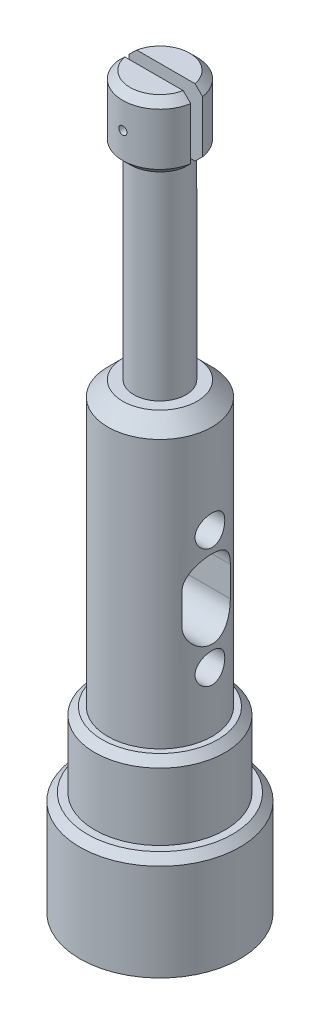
ISO-10303-21;
HEADER;
FILE_DESCRIPTION(('STEP AP214'),'2;1');
FILE_NAME('part.step','',(''),(''),'','','');
FILE_SCHEMA(('AUTOMOTIVE_DESIGN { 1 0 10303 214 1 1 1 1 }'));
ENDSEC;
DATA;
#1=APPLICATION_CONTEXT('core data for automotive mechanical design processes');
#2=APPLICATION_PROTOCOL_DEFINITION('international standard','automotive_design',2000,#1);
#3=PRODUCT_CONTEXT('',#1,'mechanical');
#4=PRODUCT('Part','Part','',(#3));
#5=PRODUCT_RELATED_PRODUCT_CATEGORY('part','',(#4));
#6=PRODUCT_DEFINITION_FORMATION('','',#4);
#7=PRODUCT_DEFINITION_CONTEXT('part definition',#1,'design');
#8=PRODUCT_DEFINITION('design','',#6,#7);
#9=PRODUCT_DEFINITION_SHAPE('','',#8);
#10=(LENGTH_UNIT() NAMED_UNIT(*) SI_UNIT(.MILLI.,.METRE.));
#11=(NAMED_UNIT(*) PLANE_ANGLE_UNIT() SI_UNIT($,.RADIAN.));
#12=(NAMED_UNIT(*) SI_UNIT($,.STERADIAN.) SOLID_ANGLE_UNIT());
#13=UNCERTAINTY_MEASURE_WITH_UNIT(LENGTH_MEASURE(1.E-05),#10,'distance_accuracy_value','');
#14=(GEOMETRIC_REPRESENTATION_CONTEXT(3) GLOBAL_UNCERTAINTY_ASSIGNED_CONTEXT((#13)) GLOBAL_UNIT_ASSIGNED_CONTEXT((#10,
#11,#12)) REPRESENTATION_CONTEXT('',''));
#15=CARTESIAN_POINT('',(0.,0.,0.));
#16=DIRECTION('',(0.,0.,1.));
#17=DIRECTION('',(1.,0.,0.));
#18=AXIS2_PLACEMENT_3D('',#15,#16,#17);
#19=CARTESIAN_POINT('',(0.,89.,0.));
#20=DIRECTION('',(0.,1.,0.));
#21=DIRECTION('',(0.,0.,1.));
#22=AXIS2_PLACEMENT_3D('',#19,#20,#21);
#23=PLANE('',#22);
#24=DIRECTION('',(1.,0.,0.));
#25=VECTOR('',#24,1.);
#26=CARTESIAN_POINT('',(-10.75,89.,0.799999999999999));
#27=LINE('',#26,#25);
#28=CARTESIAN_POINT('',(3.40734500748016,89.,0.799999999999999));
#29=VERTEX_POINT('',#28);
#30=CARTESIAN_POINT('',(3.91918358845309,89.,0.799999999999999));
#31=VERTEX_POINT('',#30);
#32=EDGE_CURVE('E709',#29,#31,#27,.T.);
#33=ORIENTED_EDGE('',*,*,#32,.T.);
#34=CARTESIAN_POINT('',(0.,89.,0.));
#35=DIRECTION('',(0.,1.,0.));
#36=DIRECTION('',(0.,0.,1.));
#37=AXIS2_PLACEMENT_3D('',#34,#35,#36);
#38=CIRCLE('',#37,4.);
#39=CARTESIAN_POINT('',(-3.91918358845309,89.,0.799999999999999));
#40=VERTEX_POINT('',#39);
#41=EDGE_CURVE('E51',#31,#40,#38,.F.);
#42=ORIENTED_EDGE('',*,*,#41,.T.);
#43=CARTESIAN_POINT('',(-3.40734500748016,89.,0.799999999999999));
#44=VERTEX_POINT('',#43);
#45=EDGE_CURVE('E733',#40,#44,#27,.T.);
#46=ORIENTED_EDGE('',*,*,#45,.T.);
#47=CARTESIAN_POINT('',(0.,89.,0.));
#48=DIRECTION('',(0.,1.,0.));
#49=DIRECTION('',(0.,0.,1.));
#50=AXIS2_PLACEMENT_3D('',#47,#48,#49);
#51=CIRCLE('',#50,3.5);
#52=EDGE_CURVE('E176',#44,#29,#51,.T.);
#53=ORIENTED_EDGE('',*,*,#52,.T.);
#54=EDGE_LOOP('',(#33,#42,#46,#53));
#55=FACE_BOUND('',#54,.T.);
#56=ADVANCED_FACE('F36',(#55),#23,.F.);
#57=CARTESIAN_POINT('',(0.,98.,0.));
#58=DIRECTION('',(0.,-1.,0.));
#59=DIRECTION('',(0.,0.,-1.));
#60=AXIS2_PLACEMENT_3D('',#57,#58,#59);
#61=CYLINDRICAL_SURFACE('',#60,5.);
#62=CARTESIAN_POINT('',(0.549999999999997,93.5000000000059,4.9696579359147));
#63=CARTESIAN_POINT('',(0.54999867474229,93.4692066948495,4.9696583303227));
#64=CARTESIAN_POINT('',(0.54740520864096,93.4383934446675,4.96994722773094));
#65=CARTESIAN_POINT('',(0.537099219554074,93.3776224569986,4.97107133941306));
#66=CARTESIAN_POINT('',(0.529381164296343,93.3476656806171,4.97190714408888));
#67=CARTESIAN_POINT('',(0.509054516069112,93.2894964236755,4.97402927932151));
#68=CARTESIAN_POINT('',(0.496449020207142,93.2612828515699,4.97531532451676));
#69=CARTESIAN_POINT('',(0.466711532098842,93.2073775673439,4.9781926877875));
#70=CARTESIAN_POINT('',(0.449580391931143,93.1816853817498,4.97978394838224));
#71=CARTESIAN_POINT('',(0.4111976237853,93.1334341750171,4.98310023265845));
#72=CARTESIAN_POINT('',(0.389930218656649,93.1108877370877,4.9848257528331));
#73=CARTESIAN_POINT('',(0.343912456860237,93.0696765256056,4.98821164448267));
#74=CARTESIAN_POINT('',(0.319161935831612,93.0510119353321,4.98987201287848));
#75=CARTESIAN_POINT('',(0.266802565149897,93.0180500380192,4.99294550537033));
#76=CARTESIAN_POINT('',(0.23918659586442,93.0037639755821,4.99435798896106));
#77=CARTESIAN_POINT('',(0.181929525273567,92.9800366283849,4.99677113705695));
#78=CARTESIAN_POINT('',(0.152288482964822,92.9705952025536,4.99777181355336));
#79=CARTESIAN_POINT('',(0.0919505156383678,92.9568623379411,4.99924510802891));
#80=CARTESIAN_POINT('',(0.0612583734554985,92.9525501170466,4.99971985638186));
#81=CARTESIAN_POINT('',(-0.000417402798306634,92.9491337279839,5.00009506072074));
#82=CARTESIAN_POINT('',(-0.0314010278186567,92.9500293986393,4.99999553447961));
#83=CARTESIAN_POINT('',(-0.0926390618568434,92.9569865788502,4.99923513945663));
#84=CARTESIAN_POINT('',(-0.12289604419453,92.9630257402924,4.99857669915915));
#85=CARTESIAN_POINT('',(-0.181964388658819,92.9800636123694,4.99677522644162));
#86=CARTESIAN_POINT('',(-0.210775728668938,92.9910623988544,4.99563218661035));
#87=CARTESIAN_POINT('',(-0.266204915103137,93.0177315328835,4.99298580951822));
#88=CARTESIAN_POINT('',(-0.292818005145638,93.0334116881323,4.99148171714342));
#89=CARTESIAN_POINT('',(-0.343043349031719,93.0689913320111,4.9882818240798));
#90=CARTESIAN_POINT('',(-0.366655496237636,93.0888909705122,4.98658601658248));
#91=CARTESIAN_POINT('',(-0.410339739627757,93.1324701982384,4.98318220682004));
#92=CARTESIAN_POINT('',(-0.430392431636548,93.1561692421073,4.98147418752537));
#93=CARTESIAN_POINT('',(-0.466238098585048,93.2066073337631,4.97824737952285));
#94=CARTESIAN_POINT('',(-0.482031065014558,93.2333463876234,4.97672859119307));
#95=CARTESIAN_POINT('',(-0.508909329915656,93.2891212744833,4.97405213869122));
#96=CARTESIAN_POINT('',(-0.519993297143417,93.3181577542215,4.97289457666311));
#97=CARTESIAN_POINT('',(-0.537122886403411,93.3776952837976,4.97107371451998));
#98=CARTESIAN_POINT('',(-0.543168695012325,93.4081962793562,4.97041039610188));
#99=CARTESIAN_POINT('',(-0.55002511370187,93.4696262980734,4.96965636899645));
#100=CARTESIAN_POINT('',(-0.550862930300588,93.5005522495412,4.96956268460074));
#101=CARTESIAN_POINT('',(-0.547351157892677,93.5621040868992,4.96995067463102));
#102=CARTESIAN_POINT('',(-0.543001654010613,93.5927299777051,4.97043233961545));
#103=CARTESIAN_POINT('',(-0.529261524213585,93.652732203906,4.97191404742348));
#104=CARTESIAN_POINT('',(-0.519883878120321,93.6821115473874,4.97291275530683));
#105=CARTESIAN_POINT('',(-0.496366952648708,93.7388804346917,4.9753149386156));
#106=CARTESIAN_POINT('',(-0.482227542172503,93.766269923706,4.97671842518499));
#107=CARTESIAN_POINT('',(-0.44952077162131,93.8184052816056,4.97977920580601));
#108=CARTESIAN_POINT('',(-0.43093545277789,93.8431398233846,4.98143751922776));
#109=CARTESIAN_POINT('',(-0.389890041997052,93.889148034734,4.98481782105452));
#110=CARTESIAN_POINT('',(-0.367429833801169,93.9104216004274,4.98653981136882));
#111=CARTESIAN_POINT('',(-0.319153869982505,93.9489984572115,4.98986248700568));
#112=CARTESIAN_POINT('',(-0.293323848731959,93.966283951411,4.99146260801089));
#113=CARTESIAN_POINT('',(-0.239111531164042,93.9962712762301,4.99435296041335));
#114=CARTESIAN_POINT('',(-0.210729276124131,94.0089731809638,4.99564319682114));
#115=CARTESIAN_POINT('',(-0.152279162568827,94.0294028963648,4.99776587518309));
#116=CARTESIAN_POINT('',(-0.122215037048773,94.0371412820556,4.99859928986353));
#117=CARTESIAN_POINT('',(-0.0612045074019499,94.0474587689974,4.99971843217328));
#118=CARTESIAN_POINT('',(-0.0302581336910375,94.0500380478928,5.00000417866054));
#119=CARTESIAN_POINT('',(0.0314640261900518,94.0499613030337,4.99999574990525));
#120=CARTESIAN_POINT('',(0.062239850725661,94.0473328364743,4.9997046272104));
#121=CARTESIAN_POINT('',(0.122909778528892,94.0369732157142,4.99858120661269));
#122=CARTESIAN_POINT('',(0.1528038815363,94.0292420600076,4.99774890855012));
#123=CARTESIAN_POINT('',(0.210860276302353,94.0089045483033,4.99563632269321));
#124=CARTESIAN_POINT('',(0.239022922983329,93.9962991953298,4.99435612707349));
#125=CARTESIAN_POINT('',(0.292837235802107,93.9665739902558,4.99149009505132));
#126=CARTESIAN_POINT('',(0.318488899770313,93.9494541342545,4.98990425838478));
#127=CARTESIAN_POINT('',(0.366694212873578,93.9110829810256,4.98659433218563));
#128=CARTESIAN_POINT('',(0.389231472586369,93.889811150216,4.98486958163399));
#129=CARTESIAN_POINT('',(0.430428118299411,93.8437814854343,4.98148171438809));
#130=CARTESIAN_POINT('',(0.449086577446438,93.8190228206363,4.97981861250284));
#131=CARTESIAN_POINT('',(0.482042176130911,93.7666385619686,4.97673697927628));
#132=CARTESIAN_POINT('',(0.496325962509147,93.7390045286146,4.9753192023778));
#133=CARTESIAN_POINT('',(0.520030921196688,93.6817313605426,4.97289765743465));
#134=CARTESIAN_POINT('',(0.529457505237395,93.6520944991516,4.97189342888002));
#135=CARTESIAN_POINT('',(0.540864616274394,93.6019125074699,4.97066244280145));
#136=CARTESIAN_POINT('',(0.544285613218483,93.5816867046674,4.97028756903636));
#137=CARTESIAN_POINT('',(0.548853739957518,93.5409768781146,4.96978518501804));
#138=CARTESIAN_POINT('',(0.550000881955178,93.5204928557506,4.96965767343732));
#139=CARTESIAN_POINT('',(0.549999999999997,93.5000000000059,4.9696579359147));
#140=B_SPLINE_CURVE_WITH_KNOTS('',3,(#62,#63,#64,#65,#66,#67,#68,#69,#70,#71,#72,#73,#74,#75,
#76,#77,#78,#79,#80,#81,#82,#83,#84,#85,#86,#87,#88,#89,#90,#91,#92,#93,#94,#95,#96,#97,#98,#99,
#100,#101,#102,#103,#104,#105,#106,#107,#108,#109,#110,#111,#112,#113,#114,#115,#116,#117,#118,
#119,#120,#121,#122,#123,#124,#125,#126,#127,#128,#129,#130,#131,#132,#133,#134,#135,#136,#137,
#138,#139),.UNSPECIFIED.,.T.,.F.,(4,2,2,2,2,2,2,2,2,2,2,2,2,2,2,2,2,2,2,2,2,2,2,2,2,2,2,2,2,2,2,
2,2,2,2,2,2,2,4),(0.,0.0923050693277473,0.184709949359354,0.277056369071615,0.36938541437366,
0.462073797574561,0.554766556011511,0.647695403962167,0.740621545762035,0.833169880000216,
0.925715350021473,1.01786075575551,1.11000757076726,1.20234880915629,1.2946933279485,
1.38752675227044,1.48036036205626,1.57322019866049,1.66607659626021,1.7584475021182,
1.85081689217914,1.94294897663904,2.03508359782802,2.12759686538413,2.22011290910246,
2.31303415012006,2.40595388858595,2.49867499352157,2.5913929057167,2.68362150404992,
2.7758501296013,2.86805978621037,2.96026952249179,3.05294739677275,3.14564739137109,
3.23862758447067,3.33150395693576,3.39293304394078,3.45436180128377),.UNSPECIFIED.);
#141=CARTESIAN_POINT('',(0.549999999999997,93.5000000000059,4.9696579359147));
#142=VERTEX_POINT('',#141);
#143=EDGE_CURVE('E736',#142,#142,#140,.T.);
#144=ORIENTED_EDGE('',*,*,#143,.T.);
#145=EDGE_LOOP('',(#144));
#146=FACE_BOUND('',#145,.T.);
#147=DIRECTION('',(0.,-1.,0.));
#148=VECTOR('',#147,1.);
#149=CARTESIAN_POINT('',(-4.93558507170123,98.,0.8));
#150=LINE('',#149,#148);
#151=CARTESIAN_POINT('',(-4.93558507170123,97.,0.8));
#152=VERTEX_POINT('',#151);
#153=CARTESIAN_POINT('',(-4.93558507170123,90.,0.8));
#154=VERTEX_POINT('',#153);
#155=EDGE_CURVE('E178',#152,#154,#150,.T.);
#156=ORIENTED_EDGE('',*,*,#155,.T.);
#157=CARTESIAN_POINT('',(0.,90.,0.));
#158=DIRECTION('',(0.,1.,0.));
#159=DIRECTION('',(0.,0.,1.));
#160=AXIS2_PLACEMENT_3D('',#157,#158,#159);
#161=CIRCLE('',#160,5.);
#162=CARTESIAN_POINT('',(4.93558507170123,90.,0.8));
#163=VERTEX_POINT('',#162);
#164=EDGE_CURVE('E399',#154,#163,#161,.T.);
#165=ORIENTED_EDGE('',*,*,#164,.T.);
#166=DIRECTION('',(0.,-1.,0.));
#167=VECTOR('',#166,1.);
#168=CARTESIAN_POINT('',(4.93558507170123,98.,0.8));
#169=LINE('',#168,#167);
#170=CARTESIAN_POINT('',(4.93558507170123,97.,0.8));
#171=VERTEX_POINT('',#170);
#172=EDGE_CURVE('E706',#163,#171,#169,.F.);
#173=ORIENTED_EDGE('',*,*,#172,.T.);
#174=CARTESIAN_POINT('',(0.,97.,0.));
#175=DIRECTION('',(0.,1.,0.));
#176=DIRECTION('',(0.,0.,1.));
#177=AXIS2_PLACEMENT_3D('',#174,#175,#176);
#178=CIRCLE('',#177,5.);
#179=EDGE_CURVE('E395',#171,#152,#178,.F.);
#180=ORIENTED_EDGE('',*,*,#179,.T.);
#181=EDGE_LOOP('',(#156,#165,#173,#180));
#182=FACE_BOUND('',#181,.T.);
#183=ADVANCED_FACE('F299',(#146,#182),#61,.T.);
#184=CARTESIAN_POINT('',(0.,98.,0.));
#185=DIRECTION('',(0.,1.,0.));
#186=DIRECTION('',(0.,0.,1.));
#187=AXIS2_PLACEMENT_3D('',#184,#185,#186);
#188=PLANE('',#187);
#189=DIRECTION('',(1.,0.,0.));
#190=VECTOR('',#189,1.);
#191=CARTESIAN_POINT('',(0.,98.,0.8));
#192=LINE('',#191,#190);
#193=CARTESIAN_POINT('',(-3.91918358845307,98.,0.8));
#194=VERTEX_POINT('',#193);
#195=CARTESIAN_POINT('',(3.91918358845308,98.,0.8));
#196=VERTEX_POINT('',#195);
#197=EDGE_CURVE('E691',#194,#196,#192,.T.);
#198=ORIENTED_EDGE('',*,*,#197,.F.);
#199=CARTESIAN_POINT('',(0.,98.,0.));
#200=DIRECTION('',(0.,1.,0.));
#201=DIRECTION('',(0.,0.,1.));
#202=AXIS2_PLACEMENT_3D('',#199,#200,#201);
#203=CIRCLE('',#202,3.99999999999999);
#204=EDGE_CURVE('E338',#194,#196,#203,.T.);
#205=ORIENTED_EDGE('',*,*,#204,.T.);
#206=EDGE_LOOP('',(#198,#205));
#207=FACE_BOUND('',#206,.T.);
#208=ADVANCED_FACE('F304',(#207),#188,.T.);
#209=CARTESIAN_POINT('',(0.,62.,0.));
#210=DIRECTION('',(0.,1.,0.));
#211=DIRECTION('',(0.,0.,1.));
#212=AXIS2_PLACEMENT_3D('',#209,#210,#211);
#213=PLANE('',#212);
#214=CARTESIAN_POINT('',(0.,62.,0.));
#215=DIRECTION('',(0.,1.,0.));
#216=DIRECTION('',(0.,0.,1.));
#217=AXIS2_PLACEMENT_3D('',#214,#215,#216);
#218=CIRCLE('',#217,5.);
#219=CARTESIAN_POINT('',(0.,62.,5.));
#220=VERTEX_POINT('',#219);
#221=EDGE_CURVE('E44',#220,#220,#218,.T.);
#222=ORIENTED_EDGE('',*,*,#221,.T.);
#223=EDGE_LOOP('',(#222));
#224=FACE_BOUND('',#223,.T.);
#225=CARTESIAN_POINT('',(0.,62.,0.));
#226=DIRECTION('',(0.,1.,0.));
#227=DIRECTION('',(0.,0.,1.));
#228=AXIS2_PLACEMENT_3D('',#225,#226,#227);
#229=CIRCLE('',#228,3.5);
#230=CARTESIAN_POINT('',(0.,62.,3.5));
#231=VERTEX_POINT('',#230);
#232=EDGE_CURVE('E183',#231,#231,#229,.T.);
#233=ORIENTED_EDGE('',*,*,#232,.F.);
#234=EDGE_LOOP('',(#233));
#235=FACE_BOUND('',#234,.T.);
#236=ADVANCED_FACE('F322',(#224,#235),#213,.T.);
#237=CARTESIAN_POINT('',(0.,24.,0.));
#238=DIRECTION('',(0.,1.,0.));
#239=DIRECTION('',(0.,0.,1.));
#240=AXIS2_PLACEMENT_3D('',#237,#238,#239);
#241=PLANE('',#240);
#242=CARTESIAN_POINT('',(0.,24.,0.));
#243=DIRECTION('',(0.,1.,0.));
#244=DIRECTION('',(0.,0.,1.));
#245=AXIS2_PLACEMENT_3D('',#242,#243,#244);
#246=CIRCLE('',#245,7.74999999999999);
#247=CARTESIAN_POINT('',(0.,24.,7.74999999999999));
#248=VERTEX_POINT('',#247);
#249=EDGE_CURVE('E410',#248,#248,#246,.T.);
#250=ORIENTED_EDGE('',*,*,#249,.T.);
#251=EDGE_LOOP('',(#250));
#252=FACE_BOUND('',#251,.T.);
#253=CARTESIAN_POINT('',(0.,24.,0.));
#254=DIRECTION('',(0.,1.,0.));
#255=DIRECTION('',(0.,0.,1.));
#256=AXIS2_PLACEMENT_3D('',#253,#254,#255);
#257=CIRCLE('',#256,7.);
#258=CARTESIAN_POINT('',(0.,24.,7.));
#259=VERTEX_POINT('',#258);
#260=EDGE_CURVE('E182',#259,#259,#257,.T.);
#261=ORIENTED_EDGE('',*,*,#260,.F.);
#262=EDGE_LOOP('',(#261));
#263=FACE_BOUND('',#262,.T.);
#264=ADVANCED_FACE('F324',(#252,#263),#241,.T.);
#265=CARTESIAN_POINT('',(0.,14.,0.));
#266=DIRECTION('',(0.,1.,0.));
#267=DIRECTION('',(0.,0.,1.));
#268=AXIS2_PLACEMENT_3D('',#265,#266,#267);
#269=PLANE('',#268);
#270=CARTESIAN_POINT('',(0.,14.,0.));
#271=DIRECTION('',(0.,1.,0.));
#272=DIRECTION('',(0.,0.,1.));
#273=AXIS2_PLACEMENT_3D('',#270,#271,#272);
#274=CIRCLE('',#273,9.75000000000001);
#275=CARTESIAN_POINT('',(0.,14.,9.75000000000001));
#276=VERTEX_POINT('',#275);
#277=EDGE_CURVE('E416',#276,#276,#274,.T.);
#278=ORIENTED_EDGE('',*,*,#277,.T.);
#279=EDGE_LOOP('',(#278));
#280=FACE_BOUND('',#279,.T.);
#281=CARTESIAN_POINT('',(0.,14.,0.));
#282=DIRECTION('',(0.,1.,0.));
#283=DIRECTION('',(0.,0.,1.));
#284=AXIS2_PLACEMENT_3D('',#281,#282,#283);
#285=CIRCLE('',#284,8.75);
#286=CARTESIAN_POINT('',(0.,14.,8.75));
#287=VERTEX_POINT('',#286);
#288=EDGE_CURVE('E192',#287,#287,#285,.T.);
#289=ORIENTED_EDGE('',*,*,#288,.F.);
#290=EDGE_LOOP('',(#289));
#291=FACE_BOUND('',#290,.T.);
#292=ADVANCED_FACE('F330',(#280,#291),#269,.T.);
#293=CARTESIAN_POINT('',(0.,14.,0.));
#294=DIRECTION('',(0.,-1.,0.));
#295=DIRECTION('',(0.,0.,-1.));
#296=AXIS2_PLACEMENT_3D('',#293,#294,#295);
#297=CYLINDRICAL_SURFACE('',#296,10.75);
#298=CARTESIAN_POINT('',(0.,13.,0.));
#299=DIRECTION('',(0.,1.,0.));
#300=DIRECTION('',(0.,0.,1.));
#301=AXIS2_PLACEMENT_3D('',#298,#299,#300);
#302=CIRCLE('',#301,10.75);
#303=CARTESIAN_POINT('',(0.,13.,10.75));
#304=VERTEX_POINT('',#303);
#305=EDGE_CURVE('E413',#304,#304,#302,.F.);
#306=ORIENTED_EDGE('',*,*,#305,.T.);
#307=EDGE_LOOP('',(#306));
#308=FACE_BOUND('',#307,.T.);
#309=CARTESIAN_POINT('',(0.,0.,0.));
#310=DIRECTION('',(0.,1.,0.));
#311=DIRECTION('',(0.,0.,1.));
#312=AXIS2_PLACEMENT_3D('',#309,#310,#311);
#313=CIRCLE('',#312,10.75);
#314=CARTESIAN_POINT('',(0.,0.,10.75));
#315=VERTEX_POINT('',#314);
#316=EDGE_CURVE('E195',#315,#315,#313,.T.);
#317=ORIENTED_EDGE('',*,*,#316,.T.);
#318=EDGE_LOOP('',(#317));
#319=FACE_BOUND('',#318,.T.);
#320=ADVANCED_FACE('F484',(#308,#319),#297,.T.);
#321=CARTESIAN_POINT('',(0.,0.,0.));
#322=DIRECTION('',(0.,1.,0.));
#323=DIRECTION('',(0.,0.,1.));
#324=AXIS2_PLACEMENT_3D('',#321,#322,#323);
#325=PLANE('',#324);
#326=CARTESIAN_POINT('',(0.,0.,0.));
#327=DIRECTION('',(0.,-1.,0.));
#328=DIRECTION('',(0.,0.,-1.));
#329=AXIS2_PLACEMENT_3D('',#326,#327,#328);
#330=CIRCLE('',#329,2.1);
#331=CARTESIAN_POINT('',(0.,0.,-2.1));
#332=VERTEX_POINT('',#331);
#333=EDGE_CURVE('E277',#332,#332,#330,.T.);
#334=ORIENTED_EDGE('',*,*,#333,.F.);
#335=EDGE_LOOP('',(#334));
#336=FACE_BOUND('',#335,.T.);
#337=ORIENTED_EDGE('',*,*,#316,.F.);
#338=EDGE_LOOP('',(#337));
#339=FACE_BOUND('',#338,.T.);
#340=ADVANCED_FACE('F479',(#336,#339),#325,.F.);
#341=CARTESIAN_POINT('',(0.,24.,0.));
#342=DIRECTION('',(0.,-1.,0.));
#343=DIRECTION('',(0.,0.,-1.));
#344=AXIS2_PLACEMENT_3D('',#341,#342,#343);
#345=CYLINDRICAL_SURFACE('',#344,8.75);
#346=CARTESIAN_POINT('',(0.,23.,0.));
#347=DIRECTION('',(0.,1.,0.));
#348=DIRECTION('',(0.,0.,1.));
#349=AXIS2_PLACEMENT_3D('',#346,#347,#348);
#350=CIRCLE('',#349,8.75);
#351=CARTESIAN_POINT('',(0.,23.,8.75));
#352=VERTEX_POINT('',#351);
#353=EDGE_CURVE('E405',#352,#352,#350,.F.);
#354=ORIENTED_EDGE('',*,*,#353,.T.);
#355=EDGE_LOOP('',(#354));
#356=FACE_BOUND('',#355,.T.);
#357=ORIENTED_EDGE('',*,*,#288,.T.);
#358=EDGE_LOOP('',(#357));
#359=FACE_BOUND('',#358,.T.);
#360=ADVANCED_FACE('F319',(#356,#359),#345,.T.);
#361=CARTESIAN_POINT('',(0.,62.,0.));
#362=DIRECTION('',(0.,-1.,0.));
#363=DIRECTION('',(0.,0.,-1.));
#364=AXIS2_PLACEMENT_3D('',#361,#362,#363);
#365=CYLINDRICAL_SURFACE('',#364,7.);
#366=CARTESIAN_POINT('',(0.,60.,0.));
#367=DIRECTION('',(0.,1.,0.));
#368=DIRECTION('',(0.,0.,1.));
#369=AXIS2_PLACEMENT_3D('',#366,#367,#368);
#370=CIRCLE('',#369,7.);
#371=CARTESIAN_POINT('',(0.,60.,7.));
#372=VERTEX_POINT('',#371);
#373=EDGE_CURVE('E11',#372,#372,#370,.F.);
#374=ORIENTED_EDGE('',*,*,#373,.T.);
#375=EDGE_LOOP('',(#374));
#376=FACE_BOUND('',#375,.T.);
#377=CARTESIAN_POINT('',(6.70820393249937,48.,-1.99999999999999));
#378=CARTESIAN_POINT('',(6.70820547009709,47.8901484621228,-1.99999802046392));
#379=CARTESIAN_POINT('',(6.71093179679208,47.7802769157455,-1.99091866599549));
#380=CARTESIAN_POINT('',(6.72150389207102,47.563728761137,-1.95492363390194));
#381=CARTESIAN_POINT('',(6.72935174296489,47.4570534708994,-1.92800070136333));
#382=CARTESIAN_POINT('',(6.74920709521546,47.2500627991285,-1.85729343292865));
#383=CARTESIAN_POINT('',(6.76120815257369,47.1497378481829,-1.81353520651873));
#384=CARTESIAN_POINT('',(6.78800921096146,46.9578321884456,-1.71048364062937));
#385=CARTESIAN_POINT('',(6.80280954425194,46.866252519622,-1.65118845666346));
#386=CARTESIAN_POINT('',(6.83401783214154,46.6918084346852,-1.51692480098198));
#387=CARTESIAN_POINT('',(6.8504575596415,46.6092321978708,-1.44158921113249));
#388=CARTESIAN_POINT('',(6.88281965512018,46.4576972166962,-1.27817124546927));
#389=CARTESIAN_POINT('',(6.89874196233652,46.3887400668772,-1.19008737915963));
#390=CARTESIAN_POINT('',(6.92863332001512,46.2651713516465,-1.00164603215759));
#391=CARTESIAN_POINT('',(6.94256054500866,46.210850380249,-0.901090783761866));
#392=CARTESIAN_POINT('',(6.96652540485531,46.119998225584,-0.69180847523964));
#393=CARTESIAN_POINT('',(6.97656379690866,46.0834635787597,-0.583083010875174));
#394=CARTESIAN_POINT('',(6.99139519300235,46.0301655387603,-0.363558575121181));
#395=CARTESIAN_POINT('',(6.99631827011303,46.0129109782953,-0.252887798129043));
#396=CARTESIAN_POINT('',(7.00082095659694,45.9971132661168,-0.030120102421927));
#397=CARTESIAN_POINT('',(7.00040158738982,45.9985665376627,0.0819765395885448));
#398=CARTESIAN_POINT('',(6.99436006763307,46.019806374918,0.300980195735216));
#399=CARTESIAN_POINT('',(6.98888870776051,46.039061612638,0.40794354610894));
#400=CARTESIAN_POINT('',(6.97353886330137,46.0944951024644,0.61705222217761));
#401=CARTESIAN_POINT('',(6.96366011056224,46.1306743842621,0.719197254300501));
#402=CARTESIAN_POINT('',(6.94039031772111,46.2193094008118,0.917073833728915));
#403=CARTESIAN_POINT('',(6.92696205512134,46.2719387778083,1.01272304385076));
#404=CARTESIAN_POINT('',(6.89802768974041,46.391844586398,1.19400724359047));
#405=CARTESIAN_POINT('',(6.88252113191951,46.4591242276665,1.279640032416));
#406=CARTESIAN_POINT('',(6.85045683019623,46.6092057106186,1.44163264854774));
#407=CARTESIAN_POINT('',(6.83388129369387,46.6924694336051,1.51756157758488));
#408=CARTESIAN_POINT('',(6.80202973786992,46.870715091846,1.65449301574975));
#409=CARTESIAN_POINT('',(6.78675382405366,46.965697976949,1.7154943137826));
#410=CARTESIAN_POINT('',(6.7591517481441,47.165730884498,1.82123335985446));
#411=CARTESIAN_POINT('',(6.74685010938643,47.2708552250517,1.8658373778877));
#412=CARTESIAN_POINT('',(6.72688544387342,47.4875531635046,1.93658951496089));
#413=CARTESIAN_POINT('',(6.71922106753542,47.5991248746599,1.96274300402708));
#414=CARTESIAN_POINT('',(6.70969115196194,47.8214804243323,1.99507417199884));
#415=CARTESIAN_POINT('',(6.70763711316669,47.932161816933,2.00190148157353));
#416=CARTESIAN_POINT('',(6.7090415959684,48.153088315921,1.99718996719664));
#417=CARTESIAN_POINT('',(6.71249942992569,48.2633334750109,1.98565343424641));
#418=CARTESIAN_POINT('',(6.72435430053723,48.477641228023,1.94511781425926));
#419=CARTESIAN_POINT('',(6.73263642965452,48.5817875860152,1.91652462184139));
#420=CARTESIAN_POINT('',(6.75309063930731,48.7838018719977,1.84315161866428));
#421=CARTESIAN_POINT('',(6.7652632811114,48.8816688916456,1.79836947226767));
#422=CARTESIAN_POINT('',(6.7925018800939,49.0710220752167,1.69261965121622));
#423=CARTESIAN_POINT('',(6.80763197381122,49.1622904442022,1.6312789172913));
#424=CARTESIAN_POINT('',(6.83893726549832,49.3334763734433,1.4946046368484));
#425=CARTESIAN_POINT('',(6.85511268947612,49.4133914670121,1.41926805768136));
#426=CARTESIAN_POINT('',(6.88734727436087,49.5623794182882,1.25370800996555));
#427=CARTESIAN_POINT('',(6.90338406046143,49.6309949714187,1.16306771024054));
#428=CARTESIAN_POINT('',(6.93297977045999,49.7520456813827,0.971185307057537));
#429=CARTESIAN_POINT('',(6.94653882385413,49.8044816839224,0.869943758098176));
#430=CARTESIAN_POINT('',(6.96956504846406,49.8911842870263,0.660433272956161));
#431=CARTESIAN_POINT('',(6.97906308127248,49.9255883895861,0.552224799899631));
#432=CARTESIAN_POINT('',(6.99303339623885,49.9756268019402,0.331245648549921));
#433=CARTESIAN_POINT('',(6.99750697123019,49.9912659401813,0.218476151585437));
#434=CARTESIAN_POINT('',(7.00085335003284,50.0029914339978,-0.00417823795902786));
#435=CARTESIAN_POINT('',(6.99991703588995,49.9997441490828,-0.114025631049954));
#436=CARTESIAN_POINT('',(6.99299069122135,49.9753617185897,-0.331545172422));
#437=CARTESIAN_POINT('',(6.98700090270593,49.954227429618,-0.439217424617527));
#438=CARTESIAN_POINT('',(6.97068801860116,49.8950686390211,-0.648404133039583));
#439=CARTESIAN_POINT('',(6.96040414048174,49.857196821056,-0.749965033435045));
#440=CARTESIAN_POINT('',(6.93657094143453,49.7657738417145,-0.945347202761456));
#441=CARTESIAN_POINT('',(6.92302111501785,49.7122202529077,-1.03916727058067));
#442=CARTESIAN_POINT('',(6.89358955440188,49.5891026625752,-1.2194334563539));
#443=CARTESIAN_POINT('',(6.8776504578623,49.5191099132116,-1.30557732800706));
#444=CARTESIAN_POINT('',(6.84544064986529,49.365890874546,-1.46512122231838));
#445=CARTESIAN_POINT('',(6.82916984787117,49.2826609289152,-1.5385177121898));
#446=CARTESIAN_POINT('',(6.79764037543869,49.1027030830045,-1.67240846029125));
#447=CARTESIAN_POINT('',(6.7824195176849,49.0056780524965,-1.73251316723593));
#448=CARTESIAN_POINT('',(6.7552844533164,48.8024781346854,-1.83547943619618));
#449=CARTESIAN_POINT('',(6.74336839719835,48.6963084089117,-1.87835064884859));
#450=CARTESIAN_POINT('',(6.72558459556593,48.4923462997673,-1.94098534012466));
#451=CARTESIAN_POINT('',(6.71912438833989,48.3953096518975,-1.96305899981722));
#452=CARTESIAN_POINT('',(6.71043369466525,48.1988538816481,-1.99256607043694));
#453=CARTESIAN_POINT('',(6.70820254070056,48.0994351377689,-2.00000179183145));
#454=CARTESIAN_POINT('',(6.70820393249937,48.,-1.99999999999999));
#455=B_SPLINE_CURVE_WITH_KNOTS('',3,(#377,#378,#379,#380,#381,#382,#383,#384,#385,#386,#387,
#388,#389,#390,#391,#392,#393,#394,#395,#396,#397,#398,#399,#400,#401,#402,#403,#404,#405,#406,
#407,#408,#409,#410,#411,#412,#413,#414,#415,#416,#417,#418,#419,#420,#421,#422,#423,#424,#425,
#426,#427,#428,#429,#430,#431,#432,#433,#434,#435,#436,#437,#438,#439,#440,#441,#442,#443,#444,
#445,#446,#447,#448,#449,#450,#451,#452,#453,#454),.UNSPECIFIED.,.T.,.F.,(4,2,2,2,2,2,2,2,2,2,2,
2,2,2,2,2,2,2,2,2,2,2,2,2,2,2,2,2,2,2,2,2,2,2,2,2,2,2,4),(0.,0.329188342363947,
0.658510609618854,0.98732418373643,1.31617681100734,1.65357167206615,1.99100601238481,
2.33471483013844,2.67835669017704,3.0130290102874,3.34763734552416,3.67257037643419,
3.99752317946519,4.32602903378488,4.65460693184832,4.99471612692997,5.33485290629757,
5.67770520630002,6.02045767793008,6.35154363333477,6.68258828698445,7.00605289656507,
7.32956419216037,7.66108006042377,7.992667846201,8.33545388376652,8.67822200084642,
9.01833685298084,9.35836417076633,9.68646897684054,10.0145580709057,10.339714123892,
10.6649205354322,10.9997976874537,11.3347674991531,11.678536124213,12.0221119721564,
12.3201328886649,12.6181067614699),.UNSPECIFIED.);
#456=CARTESIAN_POINT('',(6.70820393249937,48.,-1.99999999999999));
#457=VERTEX_POINT('',#456);
#458=EDGE_CURVE('E692',#457,#457,#455,.T.);
#459=ORIENTED_EDGE('',*,*,#458,.T.);
#460=EDGE_LOOP('',(#459));
#461=FACE_BOUND('',#460,.T.);
#462=CARTESIAN_POINT('',(6.70820393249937,32.,-1.99999999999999));
#463=CARTESIAN_POINT('',(6.70820547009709,31.8901484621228,-1.99999802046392));
#464=CARTESIAN_POINT('',(6.71093179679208,31.7802769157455,-1.99091866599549));
#465=CARTESIAN_POINT('',(6.72150389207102,31.563728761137,-1.95492363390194));
#466=CARTESIAN_POINT('',(6.72935174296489,31.4570534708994,-1.92800070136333));
#467=CARTESIAN_POINT('',(6.74920709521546,31.2500627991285,-1.85729343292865));
#468=CARTESIAN_POINT('',(6.76120815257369,31.1497378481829,-1.81353520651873));
#469=CARTESIAN_POINT('',(6.78800921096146,30.9578321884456,-1.71048364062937));
#470=CARTESIAN_POINT('',(6.80280954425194,30.866252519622,-1.65118845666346));
#471=CARTESIAN_POINT('',(6.83401783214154,30.6918084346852,-1.51692480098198));
#472=CARTESIAN_POINT('',(6.8504575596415,30.6092321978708,-1.44158921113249));
#473=CARTESIAN_POINT('',(6.88281965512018,30.4576972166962,-1.27817124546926));
#474=CARTESIAN_POINT('',(6.89874196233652,30.3887400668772,-1.19008737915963));
#475=CARTESIAN_POINT('',(6.92863332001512,30.2651713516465,-1.00164603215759));
#476=CARTESIAN_POINT('',(6.94256054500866,30.210850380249,-0.901090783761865));
#477=CARTESIAN_POINT('',(6.96652540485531,30.119998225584,-0.691808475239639));
#478=CARTESIAN_POINT('',(6.97656379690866,30.0834635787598,-0.583083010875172));
#479=CARTESIAN_POINT('',(6.99139519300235,30.0301655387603,-0.363558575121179));
#480=CARTESIAN_POINT('',(6.99631827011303,30.0129109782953,-0.252887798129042));
#481=CARTESIAN_POINT('',(7.00082095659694,29.9971132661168,-0.0301201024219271));
#482=CARTESIAN_POINT('',(7.00040158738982,29.9985665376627,0.0819765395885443));
#483=CARTESIAN_POINT('',(6.99436006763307,30.019806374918,0.300980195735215));
#484=CARTESIAN_POINT('',(6.98888870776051,30.039061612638,0.407943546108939));
#485=CARTESIAN_POINT('',(6.97353886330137,30.0944951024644,0.61705222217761));
#486=CARTESIAN_POINT('',(6.96366011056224,30.1306743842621,0.719197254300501));
#487=CARTESIAN_POINT('',(6.94039031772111,30.2193094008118,0.917073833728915));
#488=CARTESIAN_POINT('',(6.92696205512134,30.2719387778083,1.01272304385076));
#489=CARTESIAN_POINT('',(6.89802768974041,30.391844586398,1.19400724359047));
#490=CARTESIAN_POINT('',(6.88252113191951,30.4591242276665,1.279640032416));
#491=CARTESIAN_POINT('',(6.85045683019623,30.6092057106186,1.44163264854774));
#492=CARTESIAN_POINT('',(6.83388129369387,30.6924694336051,1.51756157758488));
#493=CARTESIAN_POINT('',(6.80202973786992,30.870715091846,1.65449301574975));
#494=CARTESIAN_POINT('',(6.78675382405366,30.965697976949,1.7154943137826));
#495=CARTESIAN_POINT('',(6.7591517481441,31.165730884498,1.82123335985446));
#496=CARTESIAN_POINT('',(6.74685010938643,31.2708552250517,1.8658373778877));
#497=CARTESIAN_POINT('',(6.72688544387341,31.4875531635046,1.93658951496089));
#498=CARTESIAN_POINT('',(6.71922106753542,31.5991248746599,1.96274300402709));
#499=CARTESIAN_POINT('',(6.70969115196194,31.8214804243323,1.99507417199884));
#500=CARTESIAN_POINT('',(6.70763711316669,31.932161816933,2.00190148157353));
#501=CARTESIAN_POINT('',(6.7090415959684,32.153088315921,1.99718996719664));
#502=CARTESIAN_POINT('',(6.71249942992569,32.2633334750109,1.98565343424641));
#503=CARTESIAN_POINT('',(6.72435430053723,32.477641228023,1.94511781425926));
#504=CARTESIAN_POINT('',(6.73263642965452,32.5817875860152,1.91652462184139));
#505=CARTESIAN_POINT('',(6.75309063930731,32.7838018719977,1.84315161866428));
#506=CARTESIAN_POINT('',(6.7652632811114,32.8816688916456,1.79836947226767));
#507=CARTESIAN_POINT('',(6.7925018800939,33.0710220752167,1.69261965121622));
#508=CARTESIAN_POINT('',(6.80763197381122,33.1622904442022,1.6312789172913));
#509=CARTESIAN_POINT('',(6.83893726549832,33.3334763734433,1.4946046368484));
#510=CARTESIAN_POINT('',(6.85511268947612,33.4133914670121,1.41926805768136));
#511=CARTESIAN_POINT('',(6.88734727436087,33.5623794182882,1.25370800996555));
#512=CARTESIAN_POINT('',(6.90338406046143,33.6309949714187,1.16306771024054));
#513=CARTESIAN_POINT('',(6.93297977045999,33.7520456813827,0.971185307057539));
#514=CARTESIAN_POINT('',(6.94653882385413,33.8044816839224,0.869943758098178));
#515=CARTESIAN_POINT('',(6.96956504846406,33.8911842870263,0.660433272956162));
#516=CARTESIAN_POINT('',(6.97906308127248,33.9255883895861,0.552224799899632));
#517=CARTESIAN_POINT('',(6.99303339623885,33.9756268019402,0.331245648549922));
#518=CARTESIAN_POINT('',(6.99750697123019,33.9912659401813,0.218476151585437));
#519=CARTESIAN_POINT('',(7.00085335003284,34.0029914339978,-0.00417823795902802));
#520=CARTESIAN_POINT('',(6.99991703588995,33.9997441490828,-0.114025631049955));
#521=CARTESIAN_POINT('',(6.99299069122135,33.9753617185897,-0.331545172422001));
#522=CARTESIAN_POINT('',(6.98700090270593,33.954227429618,-0.439217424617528));
#523=CARTESIAN_POINT('',(6.97068801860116,33.8950686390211,-0.648404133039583));
#524=CARTESIAN_POINT('',(6.96040414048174,33.857196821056,-0.749965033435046));
#525=CARTESIAN_POINT('',(6.93657094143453,33.7657738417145,-0.945347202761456));
#526=CARTESIAN_POINT('',(6.92302111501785,33.7122202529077,-1.03916727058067));
#527=CARTESIAN_POINT('',(6.89358955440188,33.5891026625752,-1.2194334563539));
#528=CARTESIAN_POINT('',(6.8776504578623,33.5191099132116,-1.30557732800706));
#529=CARTESIAN_POINT('',(6.84544064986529,33.365890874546,-1.46512122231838));
#530=CARTESIAN_POINT('',(6.82916984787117,33.2826609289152,-1.5385177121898));
#531=CARTESIAN_POINT('',(6.79764037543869,33.1027030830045,-1.67240846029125));
#532=CARTESIAN_POINT('',(6.7824195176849,33.0056780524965,-1.73251316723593));
#533=CARTESIAN_POINT('',(6.7552844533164,32.8024781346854,-1.83547943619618));
#534=CARTESIAN_POINT('',(6.74336839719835,32.6963084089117,-1.87835064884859));
#535=CARTESIAN_POINT('',(6.72558459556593,32.4923462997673,-1.94098534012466));
#536=CARTESIAN_POINT('',(6.71912438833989,32.3953096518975,-1.96305899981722));
#537=CARTESIAN_POINT('',(6.71043369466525,32.1988538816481,-1.99256607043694));
#538=CARTESIAN_POINT('',(6.70820254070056,32.0994351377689,-2.00000179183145));
#539=CARTESIAN_POINT('',(6.70820393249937,32.,-1.99999999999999));
#540=B_SPLINE_CURVE_WITH_KNOTS('',3,(#462,#463,#464,#465,#466,#467,#468,#469,#470,#471,#472,
#473,#474,#475,#476,#477,#478,#479,#480,#481,#482,#483,#484,#485,#486,#487,#488,#489,#490,#491,
#492,#493,#494,#495,#496,#497,#498,#499,#500,#501,#502,#503,#504,#505,#506,#507,#508,#509,#510,
#511,#512,#513,#514,#515,#516,#517,#518,#519,#520,#521,#522,#523,#524,#525,#526,#527,#528,#529,
#530,#531,#532,#533,#534,#535,#536,#537,#538,#539),.UNSPECIFIED.,.T.,.F.,(4,2,2,2,2,2,2,2,2,2,2,
2,2,2,2,2,2,2,2,2,2,2,2,2,2,2,2,2,2,2,2,2,2,2,2,2,2,2,4),(0.,0.329188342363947,
0.658510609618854,0.98732418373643,1.31617681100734,1.65357167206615,1.99100601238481,
2.33471483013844,2.67835669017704,3.0130290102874,3.34763734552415,3.67257037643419,
3.99752317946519,4.32602903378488,4.65460693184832,4.99471612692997,5.33485290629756,
5.67770520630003,6.02045767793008,6.35154363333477,6.68258828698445,7.00605289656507,
7.32956419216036,7.66108006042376,7.99266784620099,8.33545388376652,8.67822200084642,
9.01833685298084,9.35836417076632,9.68646897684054,10.0145580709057,10.339714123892,
10.6649205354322,10.9997976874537,11.3347674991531,11.678536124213,12.0221119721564,
12.3201328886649,12.6181067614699),.UNSPECIFIED.);
#541=CARTESIAN_POINT('',(6.70820393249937,32.,-1.99999999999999));
#542=VERTEX_POINT('',#541);
#543=EDGE_CURVE('E244',#542,#542,#540,.T.);
#544=ORIENTED_EDGE('',*,*,#543,.T.);
#545=EDGE_LOOP('',(#544));
#546=FACE_BOUND('',#545,.T.);
#547=DIRECTION('',(0.,-1.,0.));
#548=VECTOR('',#547,1.);
#549=CARTESIAN_POINT('',(6.19979838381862,62.,-3.25));
#550=LINE('',#549,#548);
#551=CARTESIAN_POINT('',(6.19979838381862,42.,-3.25));
#552=VERTEX_POINT('',#551);
#553=CARTESIAN_POINT('',(6.19979838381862,38.,-3.25));
#554=VERTEX_POINT('',#553);
#555=EDGE_CURVE('E235',#552,#554,#550,.T.);
#556=ORIENTED_EDGE('',*,*,#555,.T.);
#557=CARTESIAN_POINT('',(6.19979838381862,38.,-3.25));
#558=CARTESIAN_POINT('',(6.19977610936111,37.9139906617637,-3.250014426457));
#559=CARTESIAN_POINT('',(6.20158762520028,37.8279935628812,-3.24658618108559));
#560=CARTESIAN_POINT('',(6.20871103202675,37.656727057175,-3.23295756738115));
#561=CARTESIAN_POINT('',(6.21402110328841,37.5714572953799,-3.22276071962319));
#562=CARTESIAN_POINT('',(6.22793957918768,37.4026842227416,-3.19577606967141));
#563=CARTESIAN_POINT('',(6.23653122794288,37.3191741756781,-3.17902173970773));
#564=CARTESIAN_POINT('',(6.25670517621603,37.1540790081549,-3.13913021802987));
#565=CARTESIAN_POINT('',(6.2682877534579,37.0724940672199,-3.11599243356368));
#566=CARTESIAN_POINT('',(6.30693399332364,36.8317105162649,-3.03743526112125));
#567=CARTESIAN_POINT('',(6.33793562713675,36.6760425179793,-2.97280024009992));
#568=CARTESIAN_POINT('',(6.40689317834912,36.3776612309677,-2.82110506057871));
#569=CARTESIAN_POINT('',(6.44485827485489,36.2349654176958,-2.73401524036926));
#570=CARTESIAN_POINT('',(6.52670153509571,35.9556455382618,-2.5327377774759));
#571=CARTESIAN_POINT('',(6.57080756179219,35.8201447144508,-2.41708059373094));
#572=CARTESIAN_POINT('',(6.65810541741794,35.5696341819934,-2.16504351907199));
#573=CARTESIAN_POINT('',(6.701297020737,35.4546294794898,-2.02865858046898));
#574=CARTESIAN_POINT('',(6.7848221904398,35.2420280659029,-1.72961981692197));
#575=CARTESIAN_POINT('',(6.82485812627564,35.145775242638,-1.56591960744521));
#576=CARTESIAN_POINT('',(6.8946538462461,34.9826824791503,-1.2224475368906));
#577=CARTESIAN_POINT('',(6.92441923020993,34.9158265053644,-1.04268450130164));
#578=CARTESIAN_POINT('',(6.96867799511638,34.8177423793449,-0.684158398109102));
#579=CARTESIAN_POINT('',(6.98401304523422,34.7845405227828,-0.50604144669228));
#580=CARTESIAN_POINT('',(7.0007875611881,34.7482616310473,-0.146148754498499));
#581=CARTESIAN_POINT('',(7.00223390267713,34.7451696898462,0.0356251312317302));
#582=CARTESIAN_POINT('',(6.99151048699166,34.7683145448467,0.383054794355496));
#583=CARTESIAN_POINT('',(6.98035695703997,34.7923622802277,0.548894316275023));
#584=CARTESIAN_POINT('',(6.94716092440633,34.8652600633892,0.873865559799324));
#585=CARTESIAN_POINT('',(6.92511782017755,34.9141114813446,1.03299691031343));
#586=CARTESIAN_POINT('',(6.87179535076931,35.0356973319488,1.34296461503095));
#587=CARTESIAN_POINT('',(6.84038269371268,35.1087782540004,1.49364118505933));
#588=CARTESIAN_POINT('',(6.77126047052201,35.276346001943,1.78098404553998));
#589=CARTESIAN_POINT('',(6.73354849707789,35.3708410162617,1.91764494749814));
#590=CARTESIAN_POINT('',(6.65172613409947,35.5877662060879,2.18534800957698));
#591=CARTESIAN_POINT('',(6.60734435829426,35.7118796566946,2.31494564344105));
#592=CARTESIAN_POINT('',(6.5193764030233,35.9798958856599,2.55220979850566));
#593=CARTESIAN_POINT('',(6.47579080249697,36.1238124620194,2.65986089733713));
#594=CARTESIAN_POINT('',(6.39210647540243,36.4363008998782,2.85532265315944));
#595=CARTESIAN_POINT('',(6.35228628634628,36.6057394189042,2.94189079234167));
#596=CARTESIAN_POINT('',(6.30126252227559,36.8704274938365,3.04887560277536));
#597=CARTESIAN_POINT('',(6.28571014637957,36.9603740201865,3.08071784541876));
#598=CARTESIAN_POINT('',(6.25807125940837,37.1431946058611,3.13647991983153));
#599=CARTESIAN_POINT('',(6.24598322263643,37.2360673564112,3.16040323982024));
#600=CARTESIAN_POINT('',(6.22412117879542,37.4396493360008,3.20328458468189));
#601=CARTESIAN_POINT('',(6.21506725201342,37.5507543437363,3.22075331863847));
#602=CARTESIAN_POINT('',(6.20287128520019,37.774562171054,3.24413664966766));
#603=CARTESIAN_POINT('',(6.19973315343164,37.8872659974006,3.25004360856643));
#604=CARTESIAN_POINT('',(6.19979838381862,38.,3.25));
#605=B_SPLINE_CURVE_WITH_KNOTS('',3,(#557,#558,#559,#560,#561,#562,#563,#564,#565,#566,#567,
#568,#569,#570,#571,#572,#573,#574,#575,#576,#577,#578,#579,#580,#581,#582,#583,#584,#585,#586,
#587,#588,#589,#590,#591,#592,#593,#594,#595,#596,#597,#598,#599,#600,#601,#602,#603,#604),
.UNSPECIFIED.,.F.,.F.,(4,2,2,2,2,2,2,2,2,2,2,2,2,2,2,2,2,2,2,2,2,2,2,4),(0.,0.257920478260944,
0.515706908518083,0.772194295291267,1.02870550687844,1.54040020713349,2.05277432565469,
2.6009951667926,3.1493497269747,3.72856379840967,4.30746156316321,4.85000568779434,
5.39228121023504,5.89375835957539,6.39526321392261,6.90427354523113,7.41347884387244,
7.96560458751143,8.518116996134,9.09791794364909,9.38758798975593,9.67713026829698,
10.0148670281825,10.3528268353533),.UNSPECIFIED.);
#606=CARTESIAN_POINT('',(6.19979838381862,38.,3.25));
#607=VERTEX_POINT('',#606);
#608=EDGE_CURVE('E238',#554,#607,#605,.T.);
#609=ORIENTED_EDGE('',*,*,#608,.T.);
#610=DIRECTION('',(0.,-1.,0.));
#611=VECTOR('',#610,1.);
#612=CARTESIAN_POINT('',(6.19979838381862,62.,3.25));
#613=LINE('',#612,#611);
#614=CARTESIAN_POINT('',(6.19979838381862,42.,3.25));
#615=VERTEX_POINT('',#614);
#616=EDGE_CURVE('E234',#607,#615,#613,.F.);
#617=ORIENTED_EDGE('',*,*,#616,.T.);
#618=CARTESIAN_POINT('',(6.19979838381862,42.,3.25));
#619=CARTESIAN_POINT('',(6.19977610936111,42.0860093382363,3.250014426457));
#620=CARTESIAN_POINT('',(6.20158762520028,42.1720064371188,3.24658618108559));
#621=CARTESIAN_POINT('',(6.20871103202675,42.343272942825,3.23295756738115));
#622=CARTESIAN_POINT('',(6.21402110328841,42.4285427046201,3.22276071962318));
#623=CARTESIAN_POINT('',(6.22793957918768,42.5973157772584,3.19577606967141));
#624=CARTESIAN_POINT('',(6.23653122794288,42.6808258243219,3.17902173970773));
#625=CARTESIAN_POINT('',(6.25670517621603,42.8459209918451,3.13913021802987));
#626=CARTESIAN_POINT('',(6.2682877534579,42.9275059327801,3.11599243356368));
#627=CARTESIAN_POINT('',(6.30693399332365,43.1682894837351,3.03743526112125));
#628=CARTESIAN_POINT('',(6.33793562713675,43.3239574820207,2.97280024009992));
#629=CARTESIAN_POINT('',(6.40689317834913,43.6223387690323,2.8211050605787));
#630=CARTESIAN_POINT('',(6.44485827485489,43.7650345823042,2.73401524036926));
#631=CARTESIAN_POINT('',(6.52670153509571,44.0443544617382,2.5327377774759));
#632=CARTESIAN_POINT('',(6.57080756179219,44.1798552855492,2.41708059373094));
#633=CARTESIAN_POINT('',(6.65810541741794,44.4303658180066,2.16504351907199));
#634=CARTESIAN_POINT('',(6.701297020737,44.5453705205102,2.02865858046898));
#635=CARTESIAN_POINT('',(6.7848221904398,44.7579719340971,1.72961981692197));
#636=CARTESIAN_POINT('',(6.82485812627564,44.854224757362,1.56591960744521));
#637=CARTESIAN_POINT('',(6.8946538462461,45.0173175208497,1.2224475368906));
#638=CARTESIAN_POINT('',(6.92441923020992,45.0841734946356,1.04268450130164));
#639=CARTESIAN_POINT('',(6.96867799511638,45.1822576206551,0.684158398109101));
#640=CARTESIAN_POINT('',(6.98401304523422,45.2154594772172,0.506041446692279));
#641=CARTESIAN_POINT('',(7.0007875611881,45.2517383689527,0.1461487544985));
#642=CARTESIAN_POINT('',(7.00223390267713,45.2548303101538,-0.0356251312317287));
#643=CARTESIAN_POINT('',(6.99151048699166,45.2316854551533,-0.383054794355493));
#644=CARTESIAN_POINT('',(6.98035695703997,45.2076377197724,-0.548894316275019));
#645=CARTESIAN_POINT('',(6.94716092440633,45.1347399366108,-0.87386555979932));
#646=CARTESIAN_POINT('',(6.92511782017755,45.0858885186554,-1.03299691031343));
#647=CARTESIAN_POINT('',(6.87179535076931,44.9643026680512,-1.34296461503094));
#648=CARTESIAN_POINT('',(6.84038269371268,44.8912217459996,-1.49364118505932));
#649=CARTESIAN_POINT('',(6.77126047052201,44.723653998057,-1.78098404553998));
#650=CARTESIAN_POINT('',(6.73354849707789,44.6291589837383,-1.91764494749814));
#651=CARTESIAN_POINT('',(6.65172613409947,44.4122337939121,-2.18534800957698));
#652=CARTESIAN_POINT('',(6.60734435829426,44.2881203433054,-2.31494564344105));
#653=CARTESIAN_POINT('',(6.5193764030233,44.0201041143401,-2.55220979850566));
#654=CARTESIAN_POINT('',(6.47579080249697,43.8761875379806,-2.65986089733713));
#655=CARTESIAN_POINT('',(6.39210647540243,43.5636991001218,-2.85532265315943));
#656=CARTESIAN_POINT('',(6.35228628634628,43.3942605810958,-2.94189079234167));
#657=CARTESIAN_POINT('',(6.30126252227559,43.1295725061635,-3.04887560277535));
#658=CARTESIAN_POINT('',(6.28571014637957,43.0396259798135,-3.08071784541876));
#659=CARTESIAN_POINT('',(6.25807125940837,42.8568053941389,-3.13647991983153));
#660=CARTESIAN_POINT('',(6.24598322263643,42.7639326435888,-3.16040323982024));
#661=CARTESIAN_POINT('',(6.22412117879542,42.5603506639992,-3.20328458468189));
#662=CARTESIAN_POINT('',(6.21506725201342,42.4492456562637,-3.22075331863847));
#663=CARTESIAN_POINT('',(6.20287128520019,42.225437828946,-3.24413664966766));
#664=CARTESIAN_POINT('',(6.19973315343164,42.1127340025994,-3.25004360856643));
#665=CARTESIAN_POINT('',(6.19979838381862,42.,-3.25));
#666=B_SPLINE_CURVE_WITH_KNOTS('',3,(#618,#619,#620,#621,#622,#623,#624,#625,#626,#627,#628,
#629,#630,#631,#632,#633,#634,#635,#636,#637,#638,#639,#640,#641,#642,#643,#644,#645,#646,#647,
#648,#649,#650,#651,#652,#653,#654,#655,#656,#657,#658,#659,#660,#661,#662,#663,#664,#665),
.UNSPECIFIED.,.F.,.F.,(4,2,2,2,2,2,2,2,2,2,2,2,2,2,2,2,2,2,2,2,2,2,2,4),(0.,0.257920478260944,
0.515706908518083,0.772194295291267,1.02870550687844,1.5404002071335,2.05277432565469,
2.6009951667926,3.1493497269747,3.72856379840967,4.30746156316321,4.85000568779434,
5.39228121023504,5.89375835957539,6.39526321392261,6.90427354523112,7.41347884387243,
7.96560458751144,8.518116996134,9.09791794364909,9.38758798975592,9.67713026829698,
10.0148670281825,10.3528268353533),.UNSPECIFIED.);
#667=EDGE_CURVE('E227',#615,#552,#666,.T.);
#668=ORIENTED_EDGE('',*,*,#667,.T.);
#669=EDGE_LOOP('',(#556,#609,#617,#668));
#670=FACE_BOUND('',#669,.T.);
#671=DIRECTION('',(0.,-1.,0.));
#672=VECTOR('',#671,1.);
#673=CARTESIAN_POINT('',(-6.19979838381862,62.,3.25));
#674=LINE('',#673,#672);
#675=CARTESIAN_POINT('',(-6.19979838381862,42.,3.25));
#676=VERTEX_POINT('',#675);
#677=CARTESIAN_POINT('',(-6.19979838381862,38.,3.25));
#678=VERTEX_POINT('',#677);
#679=EDGE_CURVE('E209',#676,#678,#674,.T.);
#680=ORIENTED_EDGE('',*,*,#679,.T.);
#681=CARTESIAN_POINT('',(-6.19979838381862,38.,3.25));
#682=CARTESIAN_POINT('',(-6.19977610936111,37.9139906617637,3.250014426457));
#683=CARTESIAN_POINT('',(-6.20158762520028,37.8279935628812,3.24658618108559));
#684=CARTESIAN_POINT('',(-6.20871103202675,37.656727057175,3.23295756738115));
#685=CARTESIAN_POINT('',(-6.21402110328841,37.5714572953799,3.22276071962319));
#686=CARTESIAN_POINT('',(-6.22793957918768,37.4026842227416,3.19577606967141));
#687=CARTESIAN_POINT('',(-6.23653122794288,37.3191741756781,3.17902173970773));
#688=CARTESIAN_POINT('',(-6.25670517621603,37.1540790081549,3.13913021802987));
#689=CARTESIAN_POINT('',(-6.2682877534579,37.0724940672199,3.11599243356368));
#690=CARTESIAN_POINT('',(-6.30693399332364,36.8317105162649,3.03743526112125));
#691=CARTESIAN_POINT('',(-6.33793562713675,36.6760425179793,2.97280024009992));
#692=CARTESIAN_POINT('',(-6.40689317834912,36.3776612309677,2.82110506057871));
#693=CARTESIAN_POINT('',(-6.44485827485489,36.2349654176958,2.73401524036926));
#694=CARTESIAN_POINT('',(-6.52670153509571,35.9556455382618,2.5327377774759));
#695=CARTESIAN_POINT('',(-6.57080756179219,35.8201447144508,2.41708059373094));
#696=CARTESIAN_POINT('',(-6.65810541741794,35.5696341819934,2.16504351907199));
#697=CARTESIAN_POINT('',(-6.701297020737,35.4546294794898,2.02865858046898));
#698=CARTESIAN_POINT('',(-6.7848221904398,35.2420280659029,1.72961981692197));
#699=CARTESIAN_POINT('',(-6.82485812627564,35.145775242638,1.56591960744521));
#700=CARTESIAN_POINT('',(-6.8946538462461,34.9826824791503,1.2224475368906));
#701=CARTESIAN_POINT('',(-6.92441923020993,34.9158265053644,1.04268450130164));
#702=CARTESIAN_POINT('',(-6.96867799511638,34.8177423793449,0.684158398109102));
#703=CARTESIAN_POINT('',(-6.98401304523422,34.7845405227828,0.50604144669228));
#704=CARTESIAN_POINT('',(-7.0007875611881,34.7482616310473,0.146148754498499));
#705=CARTESIAN_POINT('',(-7.00223390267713,34.7451696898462,-0.0356251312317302));
#706=CARTESIAN_POINT('',(-6.99151048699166,34.7683145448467,-0.383054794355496));
#707=CARTESIAN_POINT('',(-6.98035695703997,34.7923622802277,-0.548894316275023));
#708=CARTESIAN_POINT('',(-6.94716092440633,34.8652600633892,-0.873865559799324));
#709=CARTESIAN_POINT('',(-6.92511782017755,34.9141114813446,-1.03299691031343));
#710=CARTESIAN_POINT('',(-6.87179535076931,35.0356973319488,-1.34296461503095));
#711=CARTESIAN_POINT('',(-6.84038269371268,35.1087782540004,-1.49364118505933));
#712=CARTESIAN_POINT('',(-6.77126047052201,35.276346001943,-1.78098404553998));
#713=CARTESIAN_POINT('',(-6.73354849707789,35.3708410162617,-1.91764494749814));
#714=CARTESIAN_POINT('',(-6.65172613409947,35.5877662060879,-2.18534800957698));
#715=CARTESIAN_POINT('',(-6.60734435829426,35.7118796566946,-2.31494564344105));
#716=CARTESIAN_POINT('',(-6.5193764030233,35.9798958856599,-2.55220979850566));
#717=CARTESIAN_POINT('',(-6.47579080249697,36.1238124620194,-2.65986089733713));
#718=CARTESIAN_POINT('',(-6.39210647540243,36.4363008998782,-2.85532265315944));
#719=CARTESIAN_POINT('',(-6.35228628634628,36.6057394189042,-2.94189079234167));
#720=CARTESIAN_POINT('',(-6.30126252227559,36.8704274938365,-3.04887560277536));
#721=CARTESIAN_POINT('',(-6.28571014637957,36.9603740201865,-3.08071784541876));
#722=CARTESIAN_POINT('',(-6.25807125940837,37.1431946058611,-3.13647991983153));
#723=CARTESIAN_POINT('',(-6.24598322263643,37.2360673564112,-3.16040323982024));
#724=CARTESIAN_POINT('',(-6.22412117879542,37.4396493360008,-3.20328458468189));
#725=CARTESIAN_POINT('',(-6.21506725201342,37.5507543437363,-3.22075331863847));
#726=CARTESIAN_POINT('',(-6.20287128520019,37.774562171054,-3.24413664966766));
#727=CARTESIAN_POINT('',(-6.19973315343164,37.8872659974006,-3.25004360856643));
#728=CARTESIAN_POINT('',(-6.19979838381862,38.,-3.25));
#729=B_SPLINE_CURVE_WITH_KNOTS('',3,(#681,#682,#683,#684,#685,#686,#687,#688,#689,#690,#691,
#692,#693,#694,#695,#696,#697,#698,#699,#700,#701,#702,#703,#704,#705,#706,#707,#708,#709,#710,
#711,#712,#713,#714,#715,#716,#717,#718,#719,#720,#721,#722,#723,#724,#725,#726,#727,#728),
.UNSPECIFIED.,.F.,.F.,(4,2,2,2,2,2,2,2,2,2,2,2,2,2,2,2,2,2,2,2,2,2,2,4),(0.,0.257920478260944,
0.515706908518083,0.772194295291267,1.02870550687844,1.54040020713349,2.05277432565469,
2.6009951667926,3.1493497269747,3.72856379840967,4.30746156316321,4.85000568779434,
5.39228121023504,5.89375835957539,6.39526321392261,6.90427354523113,7.41347884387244,
7.96560458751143,8.518116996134,9.09791794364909,9.38758798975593,9.67713026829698,
10.0148670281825,10.3528268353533),.UNSPECIFIED.);
#730=CARTESIAN_POINT('',(-6.19979838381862,38.,-3.25));
#731=VERTEX_POINT('',#730);
#732=EDGE_CURVE('E257',#678,#731,#729,.T.);
#733=ORIENTED_EDGE('',*,*,#732,.T.);
#734=DIRECTION('',(0.,-1.,0.));
#735=VECTOR('',#734,1.);
#736=CARTESIAN_POINT('',(-6.19979838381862,62.,-3.25));
#737=LINE('',#736,#735);
#738=CARTESIAN_POINT('',(-6.19979838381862,42.,-3.25));
#739=VERTEX_POINT('',#738);
#740=EDGE_CURVE('E198',#731,#739,#737,.F.);
#741=ORIENTED_EDGE('',*,*,#740,.T.);
#742=CARTESIAN_POINT('',(-6.19979838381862,42.,-3.25));
#743=CARTESIAN_POINT('',(-6.19977610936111,42.0860093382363,-3.250014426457));
#744=CARTESIAN_POINT('',(-6.20158762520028,42.1720064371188,-3.24658618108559));
#745=CARTESIAN_POINT('',(-6.20871103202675,42.343272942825,-3.23295756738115));
#746=CARTESIAN_POINT('',(-6.21402110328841,42.4285427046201,-3.22276071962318));
#747=CARTESIAN_POINT('',(-6.22793957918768,42.5973157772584,-3.19577606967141));
#748=CARTESIAN_POINT('',(-6.23653122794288,42.6808258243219,-3.17902173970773));
#749=CARTESIAN_POINT('',(-6.25670517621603,42.8459209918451,-3.13913021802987));
#750=CARTESIAN_POINT('',(-6.2682877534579,42.9275059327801,-3.11599243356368));
#751=CARTESIAN_POINT('',(-6.30693399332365,43.1682894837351,-3.03743526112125));
#752=CARTESIAN_POINT('',(-6.33793562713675,43.3239574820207,-2.97280024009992));
#753=CARTESIAN_POINT('',(-6.40689317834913,43.6223387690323,-2.8211050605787));
#754=CARTESIAN_POINT('',(-6.44485827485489,43.7650345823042,-2.73401524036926));
#755=CARTESIAN_POINT('',(-6.52670153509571,44.0443544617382,-2.5327377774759));
#756=CARTESIAN_POINT('',(-6.57080756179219,44.1798552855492,-2.41708059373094));
#757=CARTESIAN_POINT('',(-6.65810541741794,44.4303658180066,-2.16504351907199));
#758=CARTESIAN_POINT('',(-6.701297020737,44.5453705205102,-2.02865858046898));
#759=CARTESIAN_POINT('',(-6.7848221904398,44.7579719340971,-1.72961981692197));
#760=CARTESIAN_POINT('',(-6.82485812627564,44.854224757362,-1.56591960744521));
#761=CARTESIAN_POINT('',(-6.8946538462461,45.0173175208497,-1.2224475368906));
#762=CARTESIAN_POINT('',(-6.92441923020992,45.0841734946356,-1.04268450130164));
#763=CARTESIAN_POINT('',(-6.96867799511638,45.1822576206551,-0.684158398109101));
#764=CARTESIAN_POINT('',(-6.98401304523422,45.2154594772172,-0.506041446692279));
#765=CARTESIAN_POINT('',(-7.0007875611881,45.2517383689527,-0.1461487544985));
#766=CARTESIAN_POINT('',(-7.00223390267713,45.2548303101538,0.0356251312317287));
#767=CARTESIAN_POINT('',(-6.99151048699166,45.2316854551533,0.383054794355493));
#768=CARTESIAN_POINT('',(-6.98035695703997,45.2076377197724,0.548894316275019));
#769=CARTESIAN_POINT('',(-6.94716092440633,45.1347399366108,0.87386555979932));
#770=CARTESIAN_POINT('',(-6.92511782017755,45.0858885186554,1.03299691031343));
#771=CARTESIAN_POINT('',(-6.87179535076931,44.9643026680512,1.34296461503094));
#772=CARTESIAN_POINT('',(-6.84038269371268,44.8912217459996,1.49364118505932));
#773=CARTESIAN_POINT('',(-6.77126047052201,44.723653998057,1.78098404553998));
#774=CARTESIAN_POINT('',(-6.73354849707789,44.6291589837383,1.91764494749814));
#775=CARTESIAN_POINT('',(-6.65172613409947,44.4122337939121,2.18534800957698));
#776=CARTESIAN_POINT('',(-6.60734435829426,44.2881203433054,2.31494564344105));
#777=CARTESIAN_POINT('',(-6.5193764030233,44.0201041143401,2.55220979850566));
#778=CARTESIAN_POINT('',(-6.47579080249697,43.8761875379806,2.65986089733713));
#779=CARTESIAN_POINT('',(-6.39210647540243,43.5636991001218,2.85532265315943));
#780=CARTESIAN_POINT('',(-6.35228628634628,43.3942605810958,2.94189079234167));
#781=CARTESIAN_POINT('',(-6.30126252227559,43.1295725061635,3.04887560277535));
#782=CARTESIAN_POINT('',(-6.28571014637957,43.0396259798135,3.08071784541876));
#783=CARTESIAN_POINT('',(-6.25807125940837,42.8568053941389,3.13647991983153));
#784=CARTESIAN_POINT('',(-6.24598322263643,42.7639326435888,3.16040323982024));
#785=CARTESIAN_POINT('',(-6.22412117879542,42.5603506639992,3.20328458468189));
#786=CARTESIAN_POINT('',(-6.21506725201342,42.4492456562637,3.22075331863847));
#787=CARTESIAN_POINT('',(-6.20287128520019,42.225437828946,3.24413664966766));
#788=CARTESIAN_POINT('',(-6.19973315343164,42.1127340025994,3.25004360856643));
#789=CARTESIAN_POINT('',(-6.19979838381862,42.,3.25));
#790=B_SPLINE_CURVE_WITH_KNOTS('',3,(#742,#743,#744,#745,#746,#747,#748,#749,#750,#751,#752,
#753,#754,#755,#756,#757,#758,#759,#760,#761,#762,#763,#764,#765,#766,#767,#768,#769,#770,#771,
#772,#773,#774,#775,#776,#777,#778,#779,#780,#781,#782,#783,#784,#785,#786,#787,#788,#789),
.UNSPECIFIED.,.F.,.F.,(4,2,2,2,2,2,2,2,2,2,2,2,2,2,2,2,2,2,2,2,2,2,2,4),(0.,0.257920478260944,
0.515706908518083,0.772194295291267,1.02870550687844,1.5404002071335,2.05277432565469,
2.6009951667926,3.1493497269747,3.72856379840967,4.30746156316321,4.85000568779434,
5.39228121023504,5.89375835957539,6.39526321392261,6.90427354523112,7.41347884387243,
7.96560458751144,8.518116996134,9.09791794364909,9.38758798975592,9.67713026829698,
10.0148670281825,10.3528268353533),.UNSPECIFIED.);
#791=EDGE_CURVE('E201',#739,#676,#790,.T.);
#792=ORIENTED_EDGE('',*,*,#791,.T.);
#793=EDGE_LOOP('',(#680,#733,#741,#792));
#794=FACE_BOUND('',#793,.T.);
#795=ORIENTED_EDGE('',*,*,#260,.T.);
#796=EDGE_LOOP('',(#795));
#797=FACE_BOUND('',#796,.T.);
#798=ADVANCED_FACE('F211',(#376,#461,#546,#670,#794,#797),#365,.T.);
#799=CARTESIAN_POINT('',(0.,89.,0.));
#800=DIRECTION('',(0.,-1.,0.));
#801=DIRECTION('',(0.,0.,-1.));
#802=AXIS2_PLACEMENT_3D('',#799,#800,#801);
#803=CYLINDRICAL_SURFACE('',#802,3.5);
#804=CARTESIAN_POINT('',(3.40734500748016,89.,-0.800000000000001));
#805=VERTEX_POINT('',#804);
#806=EDGE_CURVE('E168',#29,#805,#51,.T.);
#807=ORIENTED_EDGE('',*,*,#806,.F.);
#808=ORIENTED_EDGE('',*,*,#52,.F.);
#809=CARTESIAN_POINT('',(0.,89.,0.));
#810=DIRECTION('',(0.,-1.,0.));
#811=DIRECTION('',(0.,0.,-1.));
#812=AXIS2_PLACEMENT_3D('',#809,#810,#811);
#813=CIRCLE('',#812,3.5);
#814=CARTESIAN_POINT('',(-3.40734500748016,89.,-0.800000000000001));
#815=VERTEX_POINT('',#814);
#816=EDGE_CURVE('E165',#44,#815,#813,.T.);
#817=ORIENTED_EDGE('',*,*,#816,.T.);
#818=EDGE_CURVE('E174',#805,#815,#51,.T.);
#819=ORIENTED_EDGE('',*,*,#818,.F.);
#820=EDGE_LOOP('',(#807,#808,#817,#819));
#821=FACE_BOUND('',#820,.T.);
#822=ORIENTED_EDGE('',*,*,#232,.T.);
#823=EDGE_LOOP('',(#822));
#824=FACE_BOUND('',#823,.T.);
#825=ADVANCED_FACE('F172',(#821,#824),#803,.T.);
#826=DIRECTION('',(1.,0.,0.));
#827=VECTOR('',#826,1.);
#828=CARTESIAN_POINT('',(-10.75,89.,-0.800000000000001));
#829=LINE('',#828,#827);
#830=CARTESIAN_POINT('',(-3.91918358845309,89.,-0.800000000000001));
#831=VERTEX_POINT('',#830);
#832=EDGE_CURVE('E146',#831,#815,#829,.T.);
#833=ORIENTED_EDGE('',*,*,#832,.F.);
#834=CARTESIAN_POINT('',(0.,89.,0.));
#835=DIRECTION('',(0.,1.,0.));
#836=DIRECTION('',(0.,0.,1.));
#837=AXIS2_PLACEMENT_3D('',#834,#835,#836);
#838=CIRCLE('',#837,4.);
#839=CARTESIAN_POINT('',(3.91918358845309,89.,-0.800000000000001));
#840=VERTEX_POINT('',#839);
#841=EDGE_CURVE('E422',#831,#840,#838,.F.);
#842=ORIENTED_EDGE('',*,*,#841,.T.);
#843=EDGE_CURVE('E159',#805,#840,#829,.T.);
#844=ORIENTED_EDGE('',*,*,#843,.F.);
#845=ORIENTED_EDGE('',*,*,#818,.T.);
#846=EDGE_LOOP('',(#833,#842,#844,#845));
#847=FACE_BOUND('',#846,.T.);
#848=ADVANCED_FACE('F180',(#847),#23,.F.);
#849=CARTESIAN_POINT('',(0.549999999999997,93.5000000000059,-4.9696579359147));
#850=CARTESIAN_POINT('',(0.54999867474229,93.5307933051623,-4.9696583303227));
#851=CARTESIAN_POINT('',(0.54740520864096,93.5616065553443,-4.96994722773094));
#852=CARTESIAN_POINT('',(0.537099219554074,93.6223775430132,-4.97107133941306));
#853=CARTESIAN_POINT('',(0.529381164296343,93.6523343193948,-4.97190714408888));
#854=CARTESIAN_POINT('',(0.509054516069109,93.7105035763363,-4.97402927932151));
#855=CARTESIAN_POINT('',(0.496449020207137,93.7387171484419,-4.97531532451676));
#856=CARTESIAN_POINT('',(0.466711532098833,93.7926224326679,-4.9781926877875));
#857=CARTESIAN_POINT('',(0.449580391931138,93.8183146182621,-4.97978394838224));
#858=CARTESIAN_POINT('',(0.4111976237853,93.8665658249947,-4.98310023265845));
#859=CARTESIAN_POINT('',(0.389930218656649,93.8891122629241,-4.9848257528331));
#860=CARTESIAN_POINT('',(0.343912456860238,93.9303234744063,-4.98821164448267));
#861=CARTESIAN_POINT('',(0.319161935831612,93.9489880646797,-4.98987201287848));
#862=CARTESIAN_POINT('',(0.266802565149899,93.9819499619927,-4.99294550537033));
#863=CARTESIAN_POINT('',(0.239186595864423,93.9962360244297,-4.99435798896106));
#864=CARTESIAN_POINT('',(0.181929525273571,94.0199633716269,-4.99677113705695));
#865=CARTESIAN_POINT('',(0.152288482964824,94.0294047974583,-4.99777181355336));
#866=CARTESIAN_POINT('',(0.0919505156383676,94.0431376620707,-4.99924510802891));
#867=CARTESIAN_POINT('',(0.0612583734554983,94.0474498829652,-4.99971985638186));
#868=CARTESIAN_POINT('',(-0.000417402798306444,94.0508662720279,-5.00009506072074));
#869=CARTESIAN_POINT('',(-0.0314010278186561,94.0499706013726,-4.99999553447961));
#870=CARTESIAN_POINT('',(-0.0926390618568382,94.0430134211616,-4.99923513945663));
#871=CARTESIAN_POINT('',(-0.12289604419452,94.0369742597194,-4.99857669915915));
#872=CARTESIAN_POINT('',(-0.18196438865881,94.0199363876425,-4.99677522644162));
#873=CARTESIAN_POINT('',(-0.210775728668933,94.0089376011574,-4.99563218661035));
#874=CARTESIAN_POINT('',(-0.266204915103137,93.9822684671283,-4.99298580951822));
#875=CARTESIAN_POINT('',(-0.292818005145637,93.9665883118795,-4.99148171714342));
#876=CARTESIAN_POINT('',(-0.343043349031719,93.9310086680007,-4.9882818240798));
#877=CARTESIAN_POINT('',(-0.366655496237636,93.9111090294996,-4.98658601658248));
#878=CARTESIAN_POINT('',(-0.410339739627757,93.8675298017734,-4.98318220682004));
#879=CARTESIAN_POINT('',(-0.430392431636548,93.8438307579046,-4.98147418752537));
#880=CARTESIAN_POINT('',(-0.466238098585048,93.7933926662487,-4.97824737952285));
#881=CARTESIAN_POINT('',(-0.482031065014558,93.7666536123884,-4.97672859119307));
#882=CARTESIAN_POINT('',(-0.508909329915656,93.7108787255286,-4.97405213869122));
#883=CARTESIAN_POINT('',(-0.519993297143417,93.6818422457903,-4.97289457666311));
#884=CARTESIAN_POINT('',(-0.537122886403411,93.6223047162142,-4.97107371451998));
#885=CARTESIAN_POINT('',(-0.543168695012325,93.5918037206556,-4.97041039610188));
#886=CARTESIAN_POINT('',(-0.55002511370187,93.5303737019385,-4.96965636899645));
#887=CARTESIAN_POINT('',(-0.550862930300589,93.4994477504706,-4.96956268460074));
#888=CARTESIAN_POINT('',(-0.547351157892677,93.4378959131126,-4.96995067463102));
#889=CARTESIAN_POINT('',(-0.543001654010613,93.4072700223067,-4.97043233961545));
#890=CARTESIAN_POINT('',(-0.529261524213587,93.3472677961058,-4.97191404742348));
#891=CARTESIAN_POINT('',(-0.519883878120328,93.3178884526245,-4.97291275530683));
#892=CARTESIAN_POINT('',(-0.496366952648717,93.2611195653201,-4.9753149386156));
#893=CARTESIAN_POINT('',(-0.482227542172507,93.2337300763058,-4.97671842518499));
#894=CARTESIAN_POINT('',(-0.449520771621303,93.1815947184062,-4.97977920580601));
#895=CARTESIAN_POINT('',(-0.430935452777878,93.1568601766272,-4.98143751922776));
#896=CARTESIAN_POINT('',(-0.389890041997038,93.1108519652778,-4.98481782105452));
#897=CARTESIAN_POINT('',(-0.367429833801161,93.0895783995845,-4.98653981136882));
#898=CARTESIAN_POINT('',(-0.319153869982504,93.0510015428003,-4.98986248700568));
#899=CARTESIAN_POINT('',(-0.293323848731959,93.0337160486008,-4.99146260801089));
#900=CARTESIAN_POINT('',(-0.239111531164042,93.0037287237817,-4.99435296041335));
#901=CARTESIAN_POINT('',(-0.210729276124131,92.991026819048,-4.99564319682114));
#902=CARTESIAN_POINT('',(-0.152279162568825,92.970597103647,-4.99776587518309));
#903=CARTESIAN_POINT('',(-0.122215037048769,92.9628587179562,-4.99859928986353));
#904=CARTESIAN_POINT('',(-0.0612045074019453,92.9525412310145,-4.99971843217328));
#905=CARTESIAN_POINT('',(-0.0302581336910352,92.949961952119,-5.00000417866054));
#906=CARTESIAN_POINT('',(0.0314640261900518,92.9500386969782,-4.99999574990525));
#907=CARTESIAN_POINT('',(0.0622398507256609,92.9526671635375,-4.9997046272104));
#908=CARTESIAN_POINT('',(0.122909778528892,92.9630267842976,-4.99858120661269));
#909=CARTESIAN_POINT('',(0.1528038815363,92.9707579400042,-4.99774890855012));
#910=CARTESIAN_POINT('',(0.210860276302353,92.9910954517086,-4.99563632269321));
#911=CARTESIAN_POINT('',(0.239022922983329,93.003700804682,-4.99435612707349));
#912=CARTESIAN_POINT('',(0.292837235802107,93.0334260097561,-4.99149009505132));
#913=CARTESIAN_POINT('',(0.318488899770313,93.0505458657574,-4.98990425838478));
#914=CARTESIAN_POINT('',(0.366694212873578,93.0889170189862,-4.98659433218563));
#915=CARTESIAN_POINT('',(0.389231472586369,93.1101888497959,-4.98486958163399));
#916=CARTESIAN_POINT('',(0.430428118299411,93.1562185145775,-4.98148171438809));
#917=CARTESIAN_POINT('',(0.449086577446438,93.1809771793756,-4.97981861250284));
#918=CARTESIAN_POINT('',(0.482042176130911,93.2333614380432,-4.97673697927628));
#919=CARTESIAN_POINT('',(0.496325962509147,93.2609954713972,-4.9753192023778));
#920=CARTESIAN_POINT('',(0.520030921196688,93.3182686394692,-4.97289765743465));
#921=CARTESIAN_POINT('',(0.529457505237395,93.3479055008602,-4.97189342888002));
#922=CARTESIAN_POINT('',(0.540864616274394,93.3980874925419,-4.97066244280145));
#923=CARTESIAN_POINT('',(0.544285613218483,93.4183132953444,-4.97028756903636));
#924=CARTESIAN_POINT('',(0.548853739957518,93.4590231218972,-4.96978518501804));
#925=CARTESIAN_POINT('',(0.550000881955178,93.4795071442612,-4.96965767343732));
#926=CARTESIAN_POINT('',(0.549999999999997,93.5000000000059,-4.9696579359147));
#927=B_SPLINE_CURVE_WITH_KNOTS('',3,(#849,#850,#851,#852,#853,#854,#855,#856,#857,#858,#859,
#860,#861,#862,#863,#864,#865,#866,#867,#868,#869,#870,#871,#872,#873,#874,#875,#876,#877,#878,
#879,#880,#881,#882,#883,#884,#885,#886,#887,#888,#889,#890,#891,#892,#893,#894,#895,#896,#897,
#898,#899,#900,#901,#902,#903,#904,#905,#906,#907,#908,#909,#910,#911,#912,#913,#914,#915,#916,
#917,#918,#919,#920,#921,#922,#923,#924,#925,#926),.UNSPECIFIED.,.T.,.F.,(4,2,2,2,2,2,2,2,2,2,2,
2,2,2,2,2,2,2,2,2,2,2,2,2,2,2,2,2,2,2,2,2,2,2,2,2,2,2,4),(0.,0.0923050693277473,
0.184709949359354,0.277056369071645,0.36938541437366,0.462073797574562,0.554766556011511,
0.647695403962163,0.740621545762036,0.833169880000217,0.925715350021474,1.0178607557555,
1.11000757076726,1.20234880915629,1.2946933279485,1.38752675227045,1.48036036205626,
1.57322019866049,1.66607659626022,1.75844750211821,1.85081689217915,1.94294897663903,
2.03508359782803,2.12759686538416,2.22011290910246,2.31303415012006,2.40595388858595,
2.49867499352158,2.59139290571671,2.68362150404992,2.7758501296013,2.86805978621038,
2.9602695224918,3.05294739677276,3.14564739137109,3.23862758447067,3.33150395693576,
3.39293304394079,3.45436180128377),.UNSPECIFIED.);
#928=CARTESIAN_POINT('',(0.549999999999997,93.5000000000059,-4.9696579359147));
#929=VERTEX_POINT('',#928);
#930=EDGE_CURVE('E741',#929,#929,#927,.T.);
#931=ORIENTED_EDGE('',*,*,#930,.T.);
#932=EDGE_LOOP('',(#931));
#933=FACE_BOUND('',#932,.T.);
#934=DIRECTION('',(0.,-1.,0.));
#935=VECTOR('',#934,1.);
#936=CARTESIAN_POINT('',(4.93558507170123,98.,-0.8));
#937=LINE('',#936,#935);
#938=CARTESIAN_POINT('',(4.93558507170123,97.,-0.8));
#939=VERTEX_POINT('',#938);
#940=CARTESIAN_POINT('',(4.93558507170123,90.,-0.8));
#941=VERTEX_POINT('',#940);
#942=EDGE_CURVE('E704',#939,#941,#937,.T.);
#943=ORIENTED_EDGE('',*,*,#942,.T.);
#944=CARTESIAN_POINT('',(0.,90.,0.));
#945=DIRECTION('',(0.,1.,0.));
#946=DIRECTION('',(0.,0.,1.));
#947=AXIS2_PLACEMENT_3D('',#944,#945,#946);
#948=CIRCLE('',#947,5.);
#949=CARTESIAN_POINT('',(-4.93558507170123,90.,-0.8));
#950=VERTEX_POINT('',#949);
#951=EDGE_CURVE('E703',#941,#950,#948,.T.);
#952=ORIENTED_EDGE('',*,*,#951,.T.);
#953=DIRECTION('',(0.,-1.,0.));
#954=VECTOR('',#953,1.);
#955=CARTESIAN_POINT('',(-4.93558507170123,98.,-0.8));
#956=LINE('',#955,#954);
#957=CARTESIAN_POINT('',(-4.93558507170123,97.,-0.8));
#958=VERTEX_POINT('',#957);
#959=EDGE_CURVE('E157',#950,#958,#956,.F.);
#960=ORIENTED_EDGE('',*,*,#959,.T.);
#961=CARTESIAN_POINT('',(0.,97.,0.));
#962=DIRECTION('',(0.,1.,0.));
#963=DIRECTION('',(0.,0.,1.));
#964=AXIS2_PLACEMENT_3D('',#961,#962,#963);
#965=CIRCLE('',#964,5.);
#966=EDGE_CURVE('E696',#958,#939,#965,.F.);
#967=ORIENTED_EDGE('',*,*,#966,.T.);
#968=EDGE_LOOP('',(#943,#952,#960,#967));
#969=FACE_BOUND('',#968,.T.);
#970=ADVANCED_FACE('F307',(#933,#969),#61,.T.);
#971=DIRECTION('',(-1.,0.,0.));
#972=VECTOR('',#971,1.);
#973=CARTESIAN_POINT('',(0.,98.,-0.8));
#974=LINE('',#973,#972);
#975=CARTESIAN_POINT('',(3.91918358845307,98.,-0.8));
#976=VERTEX_POINT('',#975);
#977=CARTESIAN_POINT('',(-3.91918358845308,98.,-0.8));
#978=VERTEX_POINT('',#977);
#979=EDGE_CURVE('E689',#976,#978,#974,.T.);
#980=ORIENTED_EDGE('',*,*,#979,.F.);
#981=CARTESIAN_POINT('',(0.,98.,0.));
#982=DIRECTION('',(0.,1.,0.));
#983=DIRECTION('',(0.,0.,1.));
#984=AXIS2_PLACEMENT_3D('',#981,#982,#983);
#985=CIRCLE('',#984,3.99999999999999);
#986=EDGE_CURVE('E419',#976,#978,#985,.T.);
#987=ORIENTED_EDGE('',*,*,#986,.T.);
#988=EDGE_LOOP('',(#980,#987));
#989=FACE_BOUND('',#988,.T.);
#990=ADVANCED_FACE('F296',(#989),#188,.T.);
#991=CARTESIAN_POINT('',(0.,17.4,0.));
#992=DIRECTION('',(0.,-1.,0.));
#993=DIRECTION('',(0.,0.,-1.));
#994=AXIS2_PLACEMENT_3D('',#991,#992,#993);
#995=CONICAL_SURFACE('',#994,2.1,1.02974425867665);
#996=CARTESIAN_POINT('',(0.,18.6618072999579,0.));
#997=VERTEX_POINT('',#996);
#998=VERTEX_LOOP('',#997);
#999=FACE_BOUND('',#998,.T.);
#1000=CARTESIAN_POINT('',(0.,17.4,0.));
#1001=DIRECTION('',(0.,-1.,0.));
#1002=DIRECTION('',(0.,0.,-1.));
#1003=AXIS2_PLACEMENT_3D('',#1000,#1001,#1002);
#1004=CIRCLE('',#1003,2.1);
#1005=CARTESIAN_POINT('',(0.,17.4,-2.1));
#1006=VERTEX_POINT('',#1005);
#1007=EDGE_CURVE('E186',#1006,#1006,#1004,.T.);
#1008=ORIENTED_EDGE('',*,*,#1007,.T.);
#1009=EDGE_LOOP('',(#1008));
#1010=FACE_BOUND('',#1009,.T.);
#1011=ADVANCED_FACE('F290',(#999,#1010),#995,.F.);
#1012=CARTESIAN_POINT('',(0.,0.,0.));
#1013=DIRECTION('',(0.,-1.,0.));
#1014=DIRECTION('',(0.,0.,-1.));
#1015=AXIS2_PLACEMENT_3D('',#1012,#1013,#1014);
#1016=CYLINDRICAL_SURFACE('',#1015,2.1);
#1017=ORIENTED_EDGE('',*,*,#1007,.F.);
#1018=EDGE_LOOP('',(#1017));
#1019=FACE_BOUND('',#1018,.T.);
#1020=ORIENTED_EDGE('',*,*,#333,.T.);
#1021=EDGE_LOOP('',(#1020));
#1022=FACE_BOUND('',#1021,.T.);
#1023=ADVANCED_FACE('F253',(#1019,#1022),#1016,.F.);
#1024=CARTESIAN_POINT('',(-10.75,38.,0.));
#1025=DIRECTION('',(1.,0.,0.));
#1026=DIRECTION('',(0.,0.,-1.));
#1027=AXIS2_PLACEMENT_3D('',#1024,#1025,#1026);
#1028=CYLINDRICAL_SURFACE('',#1027,3.25);
#1029=DIRECTION('',(1.,0.,0.));
#1030=VECTOR('',#1029,1.);
#1031=CARTESIAN_POINT('',(-10.75,38.,-3.25));
#1032=LINE('',#1031,#1030);
#1033=EDGE_CURVE('E279',#731,#554,#1032,.T.);
#1034=ORIENTED_EDGE('',*,*,#1033,.F.);
#1035=ORIENTED_EDGE('',*,*,#732,.F.);
#1036=DIRECTION('',(1.,0.,0.));
#1037=VECTOR('',#1036,1.);
#1038=CARTESIAN_POINT('',(-10.75,38.,3.25));
#1039=LINE('',#1038,#1037);
#1040=EDGE_CURVE('E273',#678,#607,#1039,.T.);
#1041=ORIENTED_EDGE('',*,*,#1040,.T.);
#1042=ORIENTED_EDGE('',*,*,#608,.F.);
#1043=EDGE_LOOP('',(#1034,#1035,#1041,#1042));
#1044=FACE_BOUND('',#1043,.T.);
#1045=ADVANCED_FACE('F249',(#1044),#1028,.F.);
#1046=CARTESIAN_POINT('',(-10.75,38.,3.25));
#1047=DIRECTION('',(0.,0.,1.));
#1048=DIRECTION('',(0.,-1.,0.));
#1049=AXIS2_PLACEMENT_3D('',#1046,#1047,#1048);
#1050=PLANE('',#1049);
#1051=DIRECTION('',(1.,0.,0.));
#1052=VECTOR('',#1051,1.);
#1053=CARTESIAN_POINT('',(-10.75,42.,3.25));
#1054=LINE('',#1053,#1052);
#1055=EDGE_CURVE('E271',#676,#615,#1054,.T.);
#1056=ORIENTED_EDGE('',*,*,#1055,.T.);
#1057=ORIENTED_EDGE('',*,*,#616,.F.);
#1058=ORIENTED_EDGE('',*,*,#1040,.F.);
#1059=ORIENTED_EDGE('',*,*,#679,.F.);
#1060=EDGE_LOOP('',(#1056,#1057,#1058,#1059));
#1061=FACE_BOUND('',#1060,.T.);
#1062=ADVANCED_FACE('F221',(#1061),#1050,.F.);
#1063=CARTESIAN_POINT('',(-10.75,42.,0.));
#1064=DIRECTION('',(1.,0.,0.));
#1065=DIRECTION('',(0.,0.,-1.));
#1066=AXIS2_PLACEMENT_3D('',#1063,#1064,#1065);
#1067=CYLINDRICAL_SURFACE('',#1066,3.25);
#1068=ORIENTED_EDGE('',*,*,#1055,.F.);
#1069=ORIENTED_EDGE('',*,*,#791,.F.);
#1070=DIRECTION('',(1.,0.,0.));
#1071=VECTOR('',#1070,1.);
#1072=CARTESIAN_POINT('',(-10.75,42.,-3.25));
#1073=LINE('',#1072,#1071);
#1074=EDGE_CURVE('E275',#739,#552,#1073,.T.);
#1075=ORIENTED_EDGE('',*,*,#1074,.T.);
#1076=ORIENTED_EDGE('',*,*,#667,.F.);
#1077=EDGE_LOOP('',(#1068,#1069,#1075,#1076));
#1078=FACE_BOUND('',#1077,.T.);
#1079=ADVANCED_FACE('F215',(#1078),#1067,.F.);
#1080=CARTESIAN_POINT('',(-10.75,42.,-3.25));
#1081=DIRECTION('',(0.,0.,-1.));
#1082=DIRECTION('',(0.,1.,0.));
#1083=AXIS2_PLACEMENT_3D('',#1080,#1081,#1082);
#1084=PLANE('',#1083);
#1085=ORIENTED_EDGE('',*,*,#1074,.F.);
#1086=ORIENTED_EDGE('',*,*,#740,.F.);
#1087=ORIENTED_EDGE('',*,*,#1033,.T.);
#1088=ORIENTED_EDGE('',*,*,#555,.F.);
#1089=EDGE_LOOP('',(#1085,#1086,#1087,#1088));
#1090=FACE_BOUND('',#1089,.T.);
#1091=ADVANCED_FACE('F220',(#1090),#1084,.F.);
#1092=CARTESIAN_POINT('',(7.,32.,0.));
#1093=DIRECTION('',(1.,0.,0.));
#1094=DIRECTION('',(0.,0.,-1.));
#1095=AXIS2_PLACEMENT_3D('',#1092,#1093,#1094);
#1096=CYLINDRICAL_SURFACE('',#1095,1.99999999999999);
#1097=CARTESIAN_POINT('',(-3.5,32.,0.));
#1098=DIRECTION('',(1.,0.,0.));
#1099=DIRECTION('',(0.,0.,-1.));
#1100=AXIS2_PLACEMENT_3D('',#1097,#1098,#1099);
#1101=CIRCLE('',#1100,1.99999999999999);
#1102=CARTESIAN_POINT('',(-3.5,32.,-1.99999999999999));
#1103=VERTEX_POINT('',#1102);
#1104=EDGE_CURVE('E283',#1103,#1103,#1101,.T.);
#1105=ORIENTED_EDGE('',*,*,#1104,.F.);
#1106=EDGE_LOOP('',(#1105));
#1107=FACE_BOUND('',#1106,.T.);
#1108=ORIENTED_EDGE('',*,*,#543,.F.);
#1109=EDGE_LOOP('',(#1108));
#1110=FACE_BOUND('',#1109,.T.);
#1111=ADVANCED_FACE('F621',(#1107,#1110),#1096,.F.);
#1112=CARTESIAN_POINT('',(-3.5,32.,0.));
#1113=DIRECTION('',(1.,0.,0.));
#1114=DIRECTION('',(0.,0.,-1.));
#1115=AXIS2_PLACEMENT_3D('',#1112,#1113,#1114);
#1116=CONICAL_SURFACE('',#1115,1.99999999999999,1.02974425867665);
#1117=CARTESIAN_POINT('',(-4.70172123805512,32.,0.));
#1118=VERTEX_POINT('',#1117);
#1119=VERTEX_LOOP('',#1118);
#1120=FACE_BOUND('',#1119,.T.);
#1121=ORIENTED_EDGE('',*,*,#1104,.T.);
#1122=EDGE_LOOP('',(#1121));
#1123=FACE_BOUND('',#1122,.T.);
#1124=ADVANCED_FACE('F613',(#1120,#1123),#1116,.F.);
#1125=CARTESIAN_POINT('',(7.,48.,0.));
#1126=DIRECTION('',(1.,0.,0.));
#1127=DIRECTION('',(0.,0.,-1.));
#1128=AXIS2_PLACEMENT_3D('',#1125,#1126,#1127);
#1129=CYLINDRICAL_SURFACE('',#1128,1.99999999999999);
#1130=CARTESIAN_POINT('',(-3.5,48.,0.));
#1131=DIRECTION('',(1.,0.,0.));
#1132=DIRECTION('',(0.,0.,-1.));
#1133=AXIS2_PLACEMENT_3D('',#1130,#1131,#1132);
#1134=CIRCLE('',#1133,1.99999999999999);
#1135=CARTESIAN_POINT('',(-3.5,48.,-1.99999999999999));
#1136=VERTEX_POINT('',#1135);
#1137=EDGE_CURVE('E177',#1136,#1136,#1134,.T.);
#1138=ORIENTED_EDGE('',*,*,#1137,.F.);
#1139=EDGE_LOOP('',(#1138));
#1140=FACE_BOUND('',#1139,.T.);
#1141=ORIENTED_EDGE('',*,*,#458,.F.);
#1142=EDGE_LOOP('',(#1141));
#1143=FACE_BOUND('',#1142,.T.);
#1144=ADVANCED_FACE('F364',(#1140,#1143),#1129,.F.);
#1145=CARTESIAN_POINT('',(-3.5,48.,0.));
#1146=DIRECTION('',(1.,0.,0.));
#1147=DIRECTION('',(0.,0.,-1.));
#1148=AXIS2_PLACEMENT_3D('',#1145,#1146,#1147);
#1149=CONICAL_SURFACE('',#1148,1.99999999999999,1.02974425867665);
#1150=CARTESIAN_POINT('',(-4.70172123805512,48.,0.));
#1151=VERTEX_POINT('',#1150);
#1152=VERTEX_LOOP('',#1151);
#1153=FACE_BOUND('',#1152,.T.);
#1154=ORIENTED_EDGE('',*,*,#1137,.T.);
#1155=EDGE_LOOP('',(#1154));
#1156=FACE_BOUND('',#1155,.T.);
#1157=ADVANCED_FACE('F584',(#1153,#1156),#1149,.F.);
#1158=CARTESIAN_POINT('',(-10.75,89.,0.799999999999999));
#1159=DIRECTION('',(0.,-1.,0.));
#1160=DIRECTION('',(0.,0.,-1.));
#1161=AXIS2_PLACEMENT_3D('',#1158,#1159,#1160);
#1162=PLANE('',#1161);
#1163=EDGE_CURVE('E151',#815,#805,#829,.T.);
#1164=ORIENTED_EDGE('',*,*,#1163,.F.);
#1165=ORIENTED_EDGE('',*,*,#816,.F.);
#1166=EDGE_CURVE('E734',#44,#29,#27,.T.);
#1167=ORIENTED_EDGE('',*,*,#1166,.T.);
#1168=ORIENTED_EDGE('',*,*,#806,.T.);
#1169=EDGE_LOOP('',(#1164,#1165,#1167,#1168));
#1170=FACE_BOUND('',#1169,.T.);
#1171=ADVANCED_FACE('F163',(#1170),#1162,.F.);
#1172=CARTESIAN_POINT('',(-10.75,98.,0.8));
#1173=DIRECTION('',(0.,0.,1.));
#1174=DIRECTION('',(0.,-1.,0.));
#1175=AXIS2_PLACEMENT_3D('',#1172,#1173,#1174);
#1176=PLANE('',#1175);
#1177=CARTESIAN_POINT('',(0.,93.5000000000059,0.8));
#1178=DIRECTION('',(0.,0.,1.));
#1179=DIRECTION('',(0.,-1.,0.));
#1180=AXIS2_PLACEMENT_3D('',#1177,#1178,#1179);
#1181=CIRCLE('',#1180,0.549999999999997);
#1182=CARTESIAN_POINT('',(0.,92.9500000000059,0.8));
#1183=VERTEX_POINT('',#1182);
#1184=EDGE_CURVE('E731',#1183,#1183,#1181,.T.);
#1185=ORIENTED_EDGE('',*,*,#1184,.T.);
#1186=EDGE_LOOP('',(#1185));
#1187=FACE_BOUND('',#1186,.T.);
#1188=ORIENTED_EDGE('',*,*,#172,.F.);
#1189=CARTESIAN_POINT('',(4.93558507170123,90.,0.8));
#1190=CARTESIAN_POINT('',(4.85102221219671,89.9165272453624,0.8));
#1191=CARTESIAN_POINT('',(4.76643256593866,89.8330816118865,0.799999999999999));
#1192=CARTESIAN_POINT('',(4.59718901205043,89.6662556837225,0.799999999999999));
#1193=CARTESIAN_POINT('',(4.51253510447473,89.5828753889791,0.799999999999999));
#1194=CARTESIAN_POINT('',(4.34315217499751,89.416191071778,0.799999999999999));
#1195=CARTESIAN_POINT('',(4.25842315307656,89.3328870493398,0.799999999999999));
#1196=CARTESIAN_POINT('',(4.08887483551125,89.1663707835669,0.799999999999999));
#1197=CARTESIAN_POINT('',(4.00405553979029,89.0831585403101,0.799999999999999));
#1198=CARTESIAN_POINT('',(3.91918358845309,89.,0.799999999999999));
#1199=B_SPLINE_CURVE_WITH_KNOTS('',3,(#1189,#1190,#1191,#1192,#1193,#1194,#1195,#1196,#1197,
#1198),.UNSPECIFIED.,.F.,.F.,(4,2,2,2,4),(0.,0.356464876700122,0.712929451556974,
1.06939411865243,1.42585908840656),.UNSPECIFIED.);
#1200=EDGE_CURVE('E59',#163,#31,#1199,.T.);
#1201=ORIENTED_EDGE('',*,*,#1200,.T.);
#1202=ORIENTED_EDGE('',*,*,#32,.F.);
#1203=ORIENTED_EDGE('',*,*,#1166,.F.);
#1204=ORIENTED_EDGE('',*,*,#45,.F.);
#1205=CARTESIAN_POINT('',(-3.91918358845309,89.,0.799999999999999));
#1206=CARTESIAN_POINT('',(-4.00405553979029,89.0831585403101,0.799999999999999));
#1207=CARTESIAN_POINT('',(-4.08887483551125,89.1663707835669,0.799999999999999));
#1208=CARTESIAN_POINT('',(-4.25842315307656,89.3328870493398,0.799999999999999));
#1209=CARTESIAN_POINT('',(-4.34315217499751,89.416191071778,0.799999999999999));
#1210=CARTESIAN_POINT('',(-4.51253510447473,89.5828753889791,0.799999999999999));
#1211=CARTESIAN_POINT('',(-4.59718901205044,89.6662556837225,0.799999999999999));
#1212=CARTESIAN_POINT('',(-4.76643256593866,89.8330816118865,0.799999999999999));
#1213=CARTESIAN_POINT('',(-4.85102221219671,89.9165272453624,0.799999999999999));
#1214=CARTESIAN_POINT('',(-4.93558507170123,90.,0.799999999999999));
#1215=B_SPLINE_CURVE_WITH_KNOTS('',3,(#1205,#1206,#1207,#1208,#1209,#1210,#1211,#1212,#1213,
#1214),.UNSPECIFIED.,.F.,.F.,(4,2,2,2,4),(0.,0.356464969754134,0.712929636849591,
1.06939421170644,1.42585908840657),.UNSPECIFIED.);
#1216=EDGE_CURVE('E349',#40,#154,#1215,.T.);
#1217=ORIENTED_EDGE('',*,*,#1216,.T.);
#1218=ORIENTED_EDGE('',*,*,#155,.F.);
#1219=CARTESIAN_POINT('',(-4.93558507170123,97.,0.8));
#1220=CARTESIAN_POINT('',(-4.85102221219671,97.0834727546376,0.8));
#1221=CARTESIAN_POINT('',(-4.76643256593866,97.1669183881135,0.8));
#1222=CARTESIAN_POINT('',(-4.59718901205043,97.3337443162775,0.8));
#1223=CARTESIAN_POINT('',(-4.51253510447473,97.4171246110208,0.8));
#1224=CARTESIAN_POINT('',(-4.34315217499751,97.583808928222,0.8));
#1225=CARTESIAN_POINT('',(-4.25842315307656,97.6671129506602,0.8));
#1226=CARTESIAN_POINT('',(-4.08887483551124,97.8336292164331,0.8));
#1227=CARTESIAN_POINT('',(-4.00405553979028,97.9168414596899,0.8));
#1228=CARTESIAN_POINT('',(-3.91918358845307,98.,0.8));
#1229=B_SPLINE_CURVE_WITH_KNOTS('',3,(#1219,#1220,#1221,#1222,#1223,#1224,#1225,#1226,#1227,
#1228),.UNSPECIFIED.,.F.,.F.,(4,2,2,2,4),(0.,0.356464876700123,0.712929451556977,
1.06939411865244,1.42585908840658),.UNSPECIFIED.);
#1230=EDGE_CURVE('E370',#152,#194,#1229,.T.);
#1231=ORIENTED_EDGE('',*,*,#1230,.T.);
#1232=ORIENTED_EDGE('',*,*,#197,.T.);
#1233=CARTESIAN_POINT('',(3.91918358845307,98.,0.8));
#1234=CARTESIAN_POINT('',(4.00405553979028,97.9168414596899,0.8));
#1235=CARTESIAN_POINT('',(4.08887483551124,97.8336292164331,0.8));
#1236=CARTESIAN_POINT('',(4.25842315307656,97.6671129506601,0.8));
#1237=CARTESIAN_POINT('',(4.34315217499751,97.583808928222,0.8));
#1238=CARTESIAN_POINT('',(4.51253510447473,97.4171246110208,0.8));
#1239=CARTESIAN_POINT('',(4.59718901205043,97.3337443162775,0.8));
#1240=CARTESIAN_POINT('',(4.76643256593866,97.1669183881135,0.8));
#1241=CARTESIAN_POINT('',(4.85102221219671,97.0834727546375,0.8));
#1242=CARTESIAN_POINT('',(4.93558507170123,97.,0.8));
#1243=B_SPLINE_CURVE_WITH_KNOTS('',3,(#1233,#1234,#1235,#1236,#1237,#1238,#1239,#1240,#1241,
#1242),.UNSPECIFIED.,.F.,.F.,(4,2,2,2,4),(0.,0.356464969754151,0.712929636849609,
1.06939421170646,1.42585908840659),.UNSPECIFIED.);
#1244=EDGE_CURVE('E376',#196,#171,#1243,.T.);
#1245=ORIENTED_EDGE('',*,*,#1244,.T.);
#1246=EDGE_LOOP('',(#1188,#1201,#1202,#1203,#1204,#1217,#1218,#1231,#1232,#1245));
#1247=FACE_BOUND('',#1246,.T.);
#1248=ADVANCED_FACE('F357',(#1187,#1247),#1176,.F.);
#1249=CARTESIAN_POINT('',(-10.75,98.,-0.8));
#1250=DIRECTION('',(0.,0.,-1.));
#1251=DIRECTION('',(0.,1.,0.));
#1252=AXIS2_PLACEMENT_3D('',#1249,#1250,#1251);
#1253=PLANE('',#1252);
#1254=CARTESIAN_POINT('',(0.,93.5000000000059,-0.8));
#1255=DIRECTION('',(0.,0.,-1.));
#1256=DIRECTION('',(0.,1.,0.));
#1257=AXIS2_PLACEMENT_3D('',#1254,#1255,#1256);
#1258=CIRCLE('',#1257,0.549999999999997);
#1259=CARTESIAN_POINT('',(0.,94.0500000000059,-0.8));
#1260=VERTEX_POINT('',#1259);
#1261=EDGE_CURVE('E728',#1260,#1260,#1258,.T.);
#1262=ORIENTED_EDGE('',*,*,#1261,.T.);
#1263=EDGE_LOOP('',(#1262));
#1264=FACE_BOUND('',#1263,.T.);
#1265=ORIENTED_EDGE('',*,*,#959,.F.);
#1266=CARTESIAN_POINT('',(-4.93558507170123,90.,-0.8));
#1267=CARTESIAN_POINT('',(-4.85102221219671,89.9165272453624,-0.8));
#1268=CARTESIAN_POINT('',(-4.76643256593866,89.8330816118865,-0.800000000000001));
#1269=CARTESIAN_POINT('',(-4.59718901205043,89.6662556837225,-0.800000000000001));
#1270=CARTESIAN_POINT('',(-4.51253510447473,89.5828753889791,-0.800000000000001));
#1271=CARTESIAN_POINT('',(-4.34315217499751,89.416191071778,-0.800000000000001));
#1272=CARTESIAN_POINT('',(-4.25842315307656,89.3328870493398,-0.800000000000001));
#1273=CARTESIAN_POINT('',(-4.08887483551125,89.1663707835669,-0.800000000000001));
#1274=CARTESIAN_POINT('',(-4.00405553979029,89.0831585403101,-0.800000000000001));
#1275=CARTESIAN_POINT('',(-3.91918358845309,89.,-0.800000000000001));
#1276=B_SPLINE_CURVE_WITH_KNOTS('',3,(#1266,#1267,#1268,#1269,#1270,#1271,#1272,#1273,#1274,
#1275),.UNSPECIFIED.,.F.,.F.,(4,2,2,2,4),(0.,0.356464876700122,0.712929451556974,
1.06939411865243,1.42585908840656),.UNSPECIFIED.);
#1277=EDGE_CURVE('E153',#950,#831,#1276,.T.);
#1278=ORIENTED_EDGE('',*,*,#1277,.T.);
#1279=ORIENTED_EDGE('',*,*,#832,.T.);
#1280=ORIENTED_EDGE('',*,*,#1163,.T.);
#1281=ORIENTED_EDGE('',*,*,#843,.T.);
#1282=CARTESIAN_POINT('',(3.91918358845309,89.,-0.800000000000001));
#1283=CARTESIAN_POINT('',(4.00405553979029,89.0831585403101,-0.800000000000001));
#1284=CARTESIAN_POINT('',(4.08887483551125,89.1663707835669,-0.800000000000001));
#1285=CARTESIAN_POINT('',(4.25842315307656,89.3328870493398,-0.800000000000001));
#1286=CARTESIAN_POINT('',(4.34315217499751,89.416191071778,-0.800000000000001));
#1287=CARTESIAN_POINT('',(4.51253510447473,89.5828753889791,-0.800000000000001));
#1288=CARTESIAN_POINT('',(4.59718901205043,89.6662556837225,-0.800000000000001));
#1289=CARTESIAN_POINT('',(4.76643256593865,89.8330816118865,-0.800000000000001));
#1290=CARTESIAN_POINT('',(4.85102221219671,89.9165272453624,-0.800000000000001));
#1291=CARTESIAN_POINT('',(4.93558507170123,90.,-0.800000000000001));
#1292=B_SPLINE_CURVE_WITH_KNOTS('',3,(#1282,#1283,#1284,#1285,#1286,#1287,#1288,#1289,#1290,
#1291),.UNSPECIFIED.,.F.,.F.,(4,2,2,2,4),(0.,0.356464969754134,0.712929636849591,
1.06939421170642,1.42585908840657),.UNSPECIFIED.);
#1293=EDGE_CURVE('E429',#840,#941,#1292,.T.);
#1294=ORIENTED_EDGE('',*,*,#1293,.T.);
#1295=ORIENTED_EDGE('',*,*,#942,.F.);
#1296=CARTESIAN_POINT('',(4.93558507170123,97.,-0.8));
#1297=CARTESIAN_POINT('',(4.85102221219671,97.0834727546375,-0.8));
#1298=CARTESIAN_POINT('',(4.76643256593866,97.1669183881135,-0.8));
#1299=CARTESIAN_POINT('',(4.59718901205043,97.3337443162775,-0.8));
#1300=CARTESIAN_POINT('',(4.51253510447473,97.4171246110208,-0.8));
#1301=CARTESIAN_POINT('',(4.34315217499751,97.583808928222,-0.8));
#1302=CARTESIAN_POINT('',(4.25842315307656,97.6671129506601,-0.8));
#1303=CARTESIAN_POINT('',(4.08887483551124,97.8336292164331,-0.8));
#1304=CARTESIAN_POINT('',(4.00405553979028,97.9168414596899,-0.8));
#1305=CARTESIAN_POINT('',(3.91918358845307,98.,-0.8));
#1306=B_SPLINE_CURVE_WITH_KNOTS('',3,(#1296,#1297,#1298,#1299,#1300,#1301,#1302,#1303,#1304,
#1305),.UNSPECIFIED.,.F.,.F.,(4,2,2,2,4),(0.,0.356464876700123,0.712929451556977,
1.06939411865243,1.42585908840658),.UNSPECIFIED.);
#1307=EDGE_CURVE('E448',#939,#976,#1306,.T.);
#1308=ORIENTED_EDGE('',*,*,#1307,.T.);
#1309=ORIENTED_EDGE('',*,*,#979,.T.);
#1310=CARTESIAN_POINT('',(-3.91918358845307,98.,-0.8));
#1311=CARTESIAN_POINT('',(-4.00405553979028,97.9168414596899,-0.8));
#1312=CARTESIAN_POINT('',(-4.08887483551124,97.8336292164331,-0.8));
#1313=CARTESIAN_POINT('',(-4.25842315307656,97.6671129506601,-0.8));
#1314=CARTESIAN_POINT('',(-4.34315217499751,97.583808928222,-0.8));
#1315=CARTESIAN_POINT('',(-4.51253510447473,97.4171246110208,-0.8));
#1316=CARTESIAN_POINT('',(-4.59718901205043,97.3337443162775,-0.8));
#1317=CARTESIAN_POINT('',(-4.76643256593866,97.1669183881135,-0.8));
#1318=CARTESIAN_POINT('',(-4.85102221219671,97.0834727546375,-0.8));
#1319=CARTESIAN_POINT('',(-4.93558507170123,97.,-0.8));
#1320=B_SPLINE_CURVE_WITH_KNOTS('',3,(#1310,#1311,#1312,#1313,#1314,#1315,#1316,#1317,#1318,
#1319),.UNSPECIFIED.,.F.,.F.,(4,2,2,2,4),(0.,0.356464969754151,0.712929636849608,
1.06939421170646,1.42585908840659),.UNSPECIFIED.);
#1321=EDGE_CURVE('E454',#978,#958,#1320,.T.);
#1322=ORIENTED_EDGE('',*,*,#1321,.T.);
#1323=EDGE_LOOP('',(#1265,#1278,#1279,#1280,#1281,#1294,#1295,#1308,#1309,#1322));
#1324=FACE_BOUND('',#1323,.T.);
#1325=ADVANCED_FACE('F149',(#1264,#1324),#1253,.F.);
#1326=CARTESIAN_POINT('',(0.,93.5000000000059,-10.75));
#1327=DIRECTION('',(0.,0.,1.));
#1328=DIRECTION('',(1.,0.,0.));
#1329=AXIS2_PLACEMENT_3D('',#1326,#1327,#1328);
#1330=CYLINDRICAL_SURFACE('',#1329,0.549999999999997);
#1331=ORIENTED_EDGE('',*,*,#1261,.F.);
#1332=EDGE_LOOP('',(#1331));
#1333=FACE_BOUND('',#1332,.T.);
#1334=ORIENTED_EDGE('',*,*,#930,.F.);
#1335=EDGE_LOOP('',(#1334));
#1336=FACE_BOUND('',#1335,.T.);
#1337=ADVANCED_FACE('F441',(#1333,#1336),#1330,.F.);
#1338=ORIENTED_EDGE('',*,*,#1184,.F.);
#1339=EDGE_LOOP('',(#1338));
#1340=FACE_BOUND('',#1339,.T.);
#1341=ORIENTED_EDGE('',*,*,#143,.F.);
#1342=EDGE_LOOP('',(#1341));
#1343=FACE_BOUND('',#1342,.T.);
#1344=ADVANCED_FACE('F443',(#1340,#1343),#1330,.F.);
#1345=CARTESIAN_POINT('',(0.,90.,0.));
#1346=DIRECTION('',(0.,1.,0.));
#1347=DIRECTION('',(0.,0.,1.));
#1348=AXIS2_PLACEMENT_3D('',#1345,#1346,#1347);
#1349=CONICAL_SURFACE('',#1348,5.,0.785398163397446);
#1350=ORIENTED_EDGE('',*,*,#1293,.F.);
#1351=ORIENTED_EDGE('',*,*,#841,.F.);
#1352=ORIENTED_EDGE('',*,*,#1277,.F.);
#1353=ORIENTED_EDGE('',*,*,#951,.F.);
#1354=EDGE_LOOP('',(#1350,#1351,#1352,#1353));
#1355=FACE_BOUND('',#1354,.T.);
#1356=ADVANCED_FACE('F434',(#1355),#1349,.T.);
#1357=CARTESIAN_POINT('',(0.,98.,0.));
#1358=DIRECTION('',(0.,-1.,0.));
#1359=DIRECTION('',(0.,0.,-1.));
#1360=AXIS2_PLACEMENT_3D('',#1357,#1358,#1359);
#1361=CONICAL_SURFACE('',#1360,3.99999999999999,0.785398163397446);
#1362=ORIENTED_EDGE('',*,*,#1307,.F.);
#1363=ORIENTED_EDGE('',*,*,#966,.F.);
#1364=ORIENTED_EDGE('',*,*,#1321,.F.);
#1365=ORIENTED_EDGE('',*,*,#986,.F.);
#1366=EDGE_LOOP('',(#1362,#1363,#1364,#1365));
#1367=FACE_BOUND('',#1366,.T.);
#1368=ADVANCED_FACE('F458',(#1367),#1361,.T.);
#1369=CARTESIAN_POINT('',(0.,14.,0.));
#1370=DIRECTION('',(0.,-1.,0.));
#1371=DIRECTION('',(0.,0.,-1.));
#1372=AXIS2_PLACEMENT_3D('',#1369,#1370,#1371);
#1373=CONICAL_SURFACE('',#1372,9.75000000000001,0.785398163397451);
#1374=ORIENTED_EDGE('',*,*,#305,.F.);
#1375=EDGE_LOOP('',(#1374));
#1376=FACE_BOUND('',#1375,.T.);
#1377=ORIENTED_EDGE('',*,*,#277,.F.);
#1378=EDGE_LOOP('',(#1377));
#1379=FACE_BOUND('',#1378,.T.);
#1380=ADVANCED_FACE('F462',(#1376,#1379),#1373,.T.);
#1381=CARTESIAN_POINT('',(0.,24.,0.));
#1382=DIRECTION('',(0.,-1.,0.));
#1383=DIRECTION('',(0.,0.,-1.));
#1384=AXIS2_PLACEMENT_3D('',#1381,#1382,#1383);
#1385=CONICAL_SURFACE('',#1384,7.74999999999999,0.785398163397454);
#1386=ORIENTED_EDGE('',*,*,#353,.F.);
#1387=EDGE_LOOP('',(#1386));
#1388=FACE_BOUND('',#1387,.T.);
#1389=ORIENTED_EDGE('',*,*,#249,.F.);
#1390=EDGE_LOOP('',(#1389));
#1391=FACE_BOUND('',#1390,.T.);
#1392=ADVANCED_FACE('F390',(#1388,#1391),#1385,.T.);
#1393=CARTESIAN_POINT('',(0.,90.,0.));
#1394=DIRECTION('',(0.,1.,0.));
#1395=DIRECTION('',(0.,0.,1.));
#1396=AXIS2_PLACEMENT_3D('',#1393,#1394,#1395);
#1397=CONICAL_SURFACE('',#1396,5.,0.785398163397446);
#1398=ORIENTED_EDGE('',*,*,#1216,.F.);
#1399=ORIENTED_EDGE('',*,*,#41,.F.);
#1400=ORIENTED_EDGE('',*,*,#1200,.F.);
#1401=ORIENTED_EDGE('',*,*,#164,.F.);
#1402=EDGE_LOOP('',(#1398,#1399,#1400,#1401));
#1403=FACE_BOUND('',#1402,.T.);
#1404=ADVANCED_FACE('F354',(#1403),#1397,.T.);
#1405=CARTESIAN_POINT('',(0.,98.,0.));
#1406=DIRECTION('',(0.,-1.,0.));
#1407=DIRECTION('',(0.,0.,-1.));
#1408=AXIS2_PLACEMENT_3D('',#1405,#1406,#1407);
#1409=CONICAL_SURFACE('',#1408,3.99999999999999,0.785398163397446);
#1410=ORIENTED_EDGE('',*,*,#1230,.F.);
#1411=ORIENTED_EDGE('',*,*,#179,.F.);
#1412=ORIENTED_EDGE('',*,*,#1244,.F.);
#1413=ORIENTED_EDGE('',*,*,#204,.F.);
#1414=EDGE_LOOP('',(#1410,#1411,#1412,#1413));
#1415=FACE_BOUND('',#1414,.T.);
#1416=ADVANCED_FACE('F380',(#1415),#1409,.T.);
#1417=CARTESIAN_POINT('',(0.,62.,0.));
#1418=DIRECTION('',(0.,-1.,0.));
#1419=DIRECTION('',(0.,0.,-1.));
#1420=AXIS2_PLACEMENT_3D('',#1417,#1418,#1419);
#1421=CONICAL_SURFACE('',#1420,5.,0.785398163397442);
#1422=ORIENTED_EDGE('',*,*,#373,.F.);
#1423=EDGE_LOOP('',(#1422));
#1424=FACE_BOUND('',#1423,.T.);
#1425=ORIENTED_EDGE('',*,*,#221,.F.);
#1426=EDGE_LOOP('',(#1425));
#1427=FACE_BOUND('',#1426,.T.);
#1428=ADVANCED_FACE('F38',(#1424,#1427),#1421,.T.);
#1429=CLOSED_SHELL('',(#56,#183,#208,#236,#264,#292,#320,#340,#360,#798,#825,#848,#970,#990,
#1011,#1023,#1045,#1062,#1079,#1091,#1111,#1124,#1144,#1157,#1171,#1248,#1325,#1337,#1344,#1356,
#1368,#1380,#1392,#1404,#1416,#1428));
#1430=MANIFOLD_SOLID_BREP('B2',#1429);
#1431=ADVANCED_BREP_SHAPE_REPRESENTATION('',(#18,#1430),#14);
#1432=SHAPE_DEFINITION_REPRESENTATION(#9,#1431);
ENDSEC;
END-ISO-10303-21;
